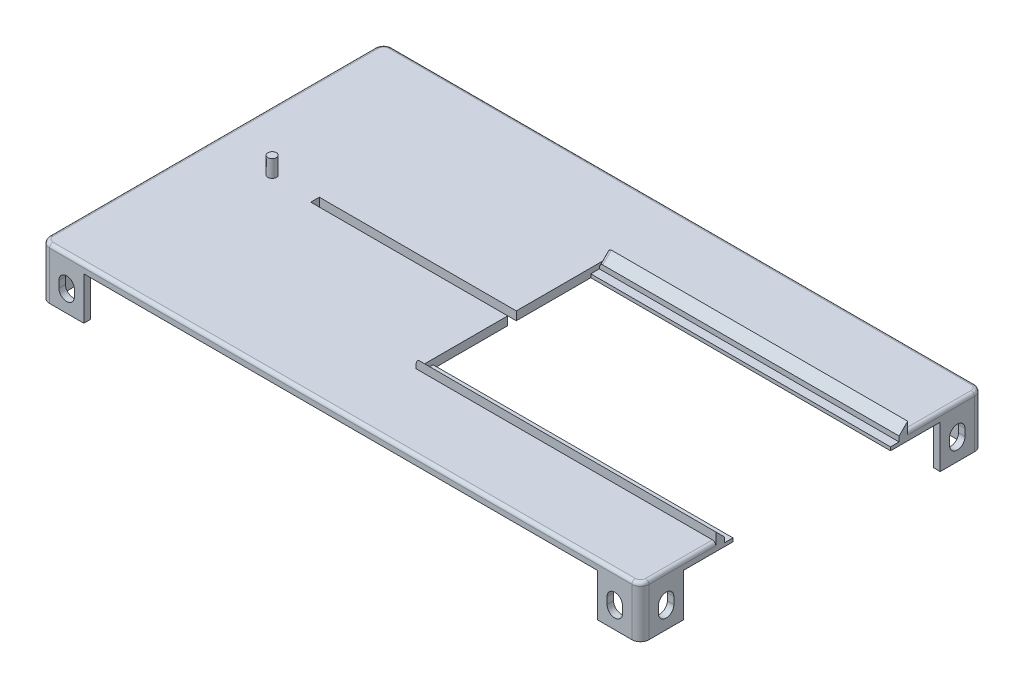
ISO-10303-21;
HEADER;
FILE_DESCRIPTION(('STEP AP214'),'2;1');
FILE_NAME('part.step','',(''),(''),'','','');
FILE_SCHEMA(('AUTOMOTIVE_DESIGN { 1 0 10303 214 1 1 1 1 }'));
ENDSEC;
DATA;
#1=APPLICATION_CONTEXT('core data for automotive mechanical design processes');
#2=APPLICATION_PROTOCOL_DEFINITION('international standard','automotive_design',2000,#1);
#3=PRODUCT_CONTEXT('',#1,'mechanical');
#4=PRODUCT('Part','Part','',(#3));
#5=PRODUCT_RELATED_PRODUCT_CATEGORY('part','',(#4));
#6=PRODUCT_DEFINITION_FORMATION('','',#4);
#7=PRODUCT_DEFINITION_CONTEXT('part definition',#1,'design');
#8=PRODUCT_DEFINITION('design','',#6,#7);
#9=PRODUCT_DEFINITION_SHAPE('','',#8);
#10=(LENGTH_UNIT() NAMED_UNIT(*) SI_UNIT(.MILLI.,.METRE.));
#11=(NAMED_UNIT(*) PLANE_ANGLE_UNIT() SI_UNIT($,.RADIAN.));
#12=(NAMED_UNIT(*) SI_UNIT($,.STERADIAN.) SOLID_ANGLE_UNIT());
#13=UNCERTAINTY_MEASURE_WITH_UNIT(LENGTH_MEASURE(1.E-05),#10,'distance_accuracy_value','');
#14=(GEOMETRIC_REPRESENTATION_CONTEXT(3) GLOBAL_UNCERTAINTY_ASSIGNED_CONTEXT((#13)) GLOBAL_UNIT_ASSIGNED_CONTEXT((#10,
#11,#12)) REPRESENTATION_CONTEXT('',''));
#15=CARTESIAN_POINT('',(0.,0.,0.));
#16=DIRECTION('',(0.,0.,1.));
#17=DIRECTION('',(1.,0.,0.));
#18=AXIS2_PLACEMENT_3D('',#15,#16,#17);
#19=CARTESIAN_POINT('',(0.,2.,0.));
#20=DIRECTION('',(-1.,0.,0.));
#21=DIRECTION('',(0.,0.,1.));
#22=AXIS2_PLACEMENT_3D('',#19,#20,#21);
#23=PLANE('',#22);
#24=DIRECTION('',(0.,0.,1.));
#25=VECTOR('',#24,1.);
#26=CARTESIAN_POINT('',(0.,5.,0.));
#27=LINE('',#26,#25);
#28=CARTESIAN_POINT('',(0.,5.,-53.8284271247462));
#29=VERTEX_POINT('',#28);
#30=CARTESIAN_POINT('',(0.,5.,-2.5));
#31=VERTEX_POINT('',#30);
#32=EDGE_CURVE('E67',#29,#31,#27,.T.);
#33=ORIENTED_EDGE('',*,*,#32,.T.);
#34=DIRECTION('',(0.,-1.,0.));
#35=VECTOR('',#34,1.);
#36=CARTESIAN_POINT('',(0.,2.,-2.5));
#37=LINE('',#36,#35);
#38=CARTESIAN_POINT('',(0.,0.,-2.5));
#39=VERTEX_POINT('',#38);
#40=EDGE_CURVE('E11',#31,#39,#37,.T.);
#41=ORIENTED_EDGE('',*,*,#40,.T.);
#42=DIRECTION('',(0.,0.,-1.));
#43=VECTOR('',#42,1.);
#44=CARTESIAN_POINT('',(0.,0.,46.));
#45=LINE('',#44,#43);
#46=CARTESIAN_POINT('',(0.,0.,-46.));
#47=VERTEX_POINT('',#46);
#48=EDGE_CURVE('E1041',#39,#47,#45,.T.);
#49=ORIENTED_EDGE('',*,*,#48,.T.);
#50=DIRECTION('',(0.,1.,0.));
#51=VECTOR('',#50,1.);
#52=CARTESIAN_POINT('',(0.,0.,-46.));
#53=LINE('',#52,#51);
#54=CARTESIAN_POINT('',(0.,2.,-46.));
#55=VERTEX_POINT('',#54);
#56=EDGE_CURVE('E1046',#47,#55,#53,.T.);
#57=ORIENTED_EDGE('',*,*,#56,.T.);
#58=DIRECTION('',(0.,0.,1.));
#59=VECTOR('',#58,1.);
#60=CARTESIAN_POINT('',(0.,2.,0.));
#61=LINE('',#60,#59);
#62=CARTESIAN_POINT('',(0.,2.,-51.));
#63=VERTEX_POINT('',#62);
#64=EDGE_CURVE('E1066',#63,#55,#61,.T.);
#65=ORIENTED_EDGE('',*,*,#64,.F.);
#66=DIRECTION('',(0.,1.,0.));
#67=VECTOR('',#66,1.);
#68=CARTESIAN_POINT('',(0.,2.,-51.));
#69=LINE('',#68,#67);
#70=CARTESIAN_POINT('',(0.,2.17157287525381,-51.));
#71=VERTEX_POINT('',#70);
#72=EDGE_CURVE('E1094',#63,#71,#69,.T.);
#73=ORIENTED_EDGE('',*,*,#72,.T.);
#74=DIRECTION('',(0.,0.707106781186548,-0.707106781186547));
#75=VECTOR('',#74,1.);
#76=CARTESIAN_POINT('',(0.,3.58578643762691,-52.4142135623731));
#77=LINE('',#76,#75);
#78=EDGE_CURVE('E1387',#71,#29,#77,.T.);
#79=ORIENTED_EDGE('',*,*,#78,.T.);
#80=EDGE_LOOP('',(#33,#41,#49,#57,#65,#73,#79));
#81=FACE_BOUND('',#80,.T.);
#82=ADVANCED_FACE('F43',(#81),#23,.F.);
#83=CARTESIAN_POINT('',(-175.,5.,100.));
#84=DIRECTION('',(1.,0.,0.));
#85=DIRECTION('',(0.,0.,-1.));
#86=AXIS2_PLACEMENT_3D('',#83,#84,#85);
#87=PLANE('',#86);
#88=DIRECTION('',(0.,-1.,0.));
#89=VECTOR('',#88,1.);
#90=CARTESIAN_POINT('',(-175.,5.,95.));
#91=LINE('',#90,#89);
#92=CARTESIAN_POINT('',(-175.,-25.,95.));
#93=VERTEX_POINT('',#92);
#94=CARTESIAN_POINT('',(-175.,3.,95.));
#95=VERTEX_POINT('',#94);
#96=EDGE_CURVE('E1125',#93,#95,#91,.F.);
#97=ORIENTED_EDGE('',*,*,#96,.T.);
#98=DIRECTION('',(0.,0.,1.));
#99=VECTOR('',#98,1.);
#100=CARTESIAN_POINT('',(-175.,3.,100.));
#101=LINE('',#100,#99);
#102=CARTESIAN_POINT('',(-175.,3.,-95.));
#103=VERTEX_POINT('',#102);
#104=EDGE_CURVE('E1199',#95,#103,#101,.F.);
#105=ORIENTED_EDGE('',*,*,#104,.T.);
#106=DIRECTION('',(0.,-1.,0.));
#107=VECTOR('',#106,1.);
#108=CARTESIAN_POINT('',(-175.,5.,-95.));
#109=LINE('',#108,#107);
#110=CARTESIAN_POINT('',(-175.,-25.,-95.));
#111=VERTEX_POINT('',#110);
#112=EDGE_CURVE('E1129',#103,#111,#109,.T.);
#113=ORIENTED_EDGE('',*,*,#112,.T.);
#114=DIRECTION('',(0.,0.,-1.));
#115=VECTOR('',#114,1.);
#116=CARTESIAN_POINT('',(-175.,-25.,-100.));
#117=LINE('',#116,#115);
#118=CARTESIAN_POINT('',(-175.,-25.,-75.));
#119=VERTEX_POINT('',#118);
#120=EDGE_CURVE('E888',#119,#111,#117,.T.);
#121=ORIENTED_EDGE('',*,*,#120,.F.);
#122=DIRECTION('',(0.,1.,0.));
#123=VECTOR('',#122,1.);
#124=CARTESIAN_POINT('',(-175.,-25.,-75.));
#125=LINE('',#124,#123);
#126=CARTESIAN_POINT('',(-175.,0.,-75.));
#127=VERTEX_POINT('',#126);
#128=EDGE_CURVE('E930',#119,#127,#125,.T.);
#129=ORIENTED_EDGE('',*,*,#128,.T.);
#130=DIRECTION('',(0.,0.,1.));
#131=VECTOR('',#130,1.);
#132=CARTESIAN_POINT('',(-175.,0.,100.));
#133=LINE('',#132,#131);
#134=CARTESIAN_POINT('',(-175.,0.,75.));
#135=VERTEX_POINT('',#134);
#136=EDGE_CURVE('E1117',#127,#135,#133,.T.);
#137=ORIENTED_EDGE('',*,*,#136,.T.);
#138=DIRECTION('',(0.,1.,0.));
#139=VECTOR('',#138,1.);
#140=CARTESIAN_POINT('',(-175.,-25.,75.));
#141=LINE('',#140,#139);
#142=CARTESIAN_POINT('',(-175.,-25.,75.));
#143=VERTEX_POINT('',#142);
#144=EDGE_CURVE('E880',#143,#135,#141,.T.);
#145=ORIENTED_EDGE('',*,*,#144,.F.);
#146=DIRECTION('',(0.,0.,-1.));
#147=VECTOR('',#146,1.);
#148=CARTESIAN_POINT('',(-175.,-25.,100.));
#149=LINE('',#148,#147);
#150=EDGE_CURVE('E834',#93,#143,#149,.T.);
#151=ORIENTED_EDGE('',*,*,#150,.F.);
#152=EDGE_LOOP('',(#97,#105,#113,#121,#129,#137,#145,#151));
#153=FACE_BOUND('',#152,.T.);
#154=CARTESIAN_POINT('',(-175.,-14.5237678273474,85.));
#155=DIRECTION('',(1.,0.,0.));
#156=DIRECTION('',(0.,0.,-1.));
#157=AXIS2_PLACEMENT_3D('',#154,#155,#156);
#158=CIRCLE('',#157,4.5);
#159=CARTESIAN_POINT('',(-175.,-14.5237678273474,89.5));
#160=VERTEX_POINT('',#159);
#161=CARTESIAN_POINT('',(-175.,-14.5237678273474,80.5));
#162=VERTEX_POINT('',#161);
#163=EDGE_CURVE('E580',#160,#162,#158,.T.);
#164=ORIENTED_EDGE('',*,*,#163,.T.);
#165=DIRECTION('',(0.,1.,0.));
#166=VECTOR('',#165,1.);
#167=CARTESIAN_POINT('',(-175.,-14.5237678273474,80.5));
#168=LINE('',#167,#166);
#169=CARTESIAN_POINT('',(-175.,-10.4762321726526,80.5));
#170=VERTEX_POINT('',#169);
#171=EDGE_CURVE('E592',#162,#170,#168,.T.);
#172=ORIENTED_EDGE('',*,*,#171,.T.);
#173=CARTESIAN_POINT('',(-175.,-10.4762321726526,85.));
#174=DIRECTION('',(1.,0.,0.));
#175=DIRECTION('',(0.,0.,-1.));
#176=AXIS2_PLACEMENT_3D('',#173,#174,#175);
#177=CIRCLE('',#176,4.5);
#178=CARTESIAN_POINT('',(-175.,-10.4762321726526,89.5));
#179=VERTEX_POINT('',#178);
#180=EDGE_CURVE('E588',#170,#179,#177,.T.);
#181=ORIENTED_EDGE('',*,*,#180,.T.);
#182=DIRECTION('',(0.,-1.,0.));
#183=VECTOR('',#182,1.);
#184=CARTESIAN_POINT('',(-175.,-14.5237678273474,89.5));
#185=LINE('',#184,#183);
#186=EDGE_CURVE('E584',#179,#160,#185,.T.);
#187=ORIENTED_EDGE('',*,*,#186,.T.);
#188=EDGE_LOOP('',(#164,#172,#181,#187));
#189=FACE_BOUND('',#188,.T.);
#190=ADVANCED_FACE('F1452',(#153,#189),#87,.F.);
#191=CARTESIAN_POINT('',(-171.2,-25.,75.));
#192=DIRECTION('',(-1.,0.,0.));
#193=DIRECTION('',(0.,0.,1.));
#194=AXIS2_PLACEMENT_3D('',#191,#192,#193);
#195=PLANE('',#194);
#196=DIRECTION('',(0.,0.,1.));
#197=VECTOR('',#196,1.);
#198=CARTESIAN_POINT('',(-171.2,0.,75.));
#199=LINE('',#198,#197);
#200=CARTESIAN_POINT('',(-171.2,0.,75.));
#201=VERTEX_POINT('',#200);
#202=CARTESIAN_POINT('',(-171.2,0.,96.2));
#203=VERTEX_POINT('',#202);
#204=EDGE_CURVE('E857',#201,#203,#199,.T.);
#205=ORIENTED_EDGE('',*,*,#204,.T.);
#206=DIRECTION('',(0.,1.,0.));
#207=VECTOR('',#206,1.);
#208=CARTESIAN_POINT('',(-171.2,-25.,96.2));
#209=LINE('',#208,#207);
#210=CARTESIAN_POINT('',(-171.2,-25.,96.2));
#211=VERTEX_POINT('',#210);
#212=EDGE_CURVE('E872',#211,#203,#209,.T.);
#213=ORIENTED_EDGE('',*,*,#212,.F.);
#214=DIRECTION('',(0.,0.,1.));
#215=VECTOR('',#214,1.);
#216=CARTESIAN_POINT('',(-171.2,-25.,75.));
#217=LINE('',#216,#215);
#218=CARTESIAN_POINT('',(-171.2,-25.,75.));
#219=VERTEX_POINT('',#218);
#220=EDGE_CURVE('E841',#219,#211,#217,.T.);
#221=ORIENTED_EDGE('',*,*,#220,.F.);
#222=DIRECTION('',(0.,1.,0.));
#223=VECTOR('',#222,1.);
#224=CARTESIAN_POINT('',(-171.2,-25.,75.));
#225=LINE('',#224,#223);
#226=EDGE_CURVE('E876',#219,#201,#225,.T.);
#227=ORIENTED_EDGE('',*,*,#226,.T.);
#228=EDGE_LOOP('',(#205,#213,#221,#227));
#229=FACE_BOUND('',#228,.T.);
#230=CARTESIAN_POINT('',(-171.2,-14.5237678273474,85.));
#231=DIRECTION('',(-1.,0.,0.));
#232=DIRECTION('',(0.,0.,1.));
#233=AXIS2_PLACEMENT_3D('',#230,#231,#232);
#234=CIRCLE('',#233,4.5);
#235=CARTESIAN_POINT('',(-171.2,-14.5237678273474,89.5));
#236=VERTEX_POINT('',#235);
#237=CARTESIAN_POINT('',(-171.2,-14.5237678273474,80.5));
#238=VERTEX_POINT('',#237);
#239=EDGE_CURVE('E1354',#236,#238,#234,.F.);
#240=ORIENTED_EDGE('',*,*,#239,.F.);
#241=DIRECTION('',(0.,-1.,0.));
#242=VECTOR('',#241,1.);
#243=CARTESIAN_POINT('',(-171.2,-25.,89.5));
#244=LINE('',#243,#242);
#245=CARTESIAN_POINT('',(-171.2,-10.4762321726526,89.5));
#246=VERTEX_POINT('',#245);
#247=EDGE_CURVE('E1344',#246,#236,#244,.T.);
#248=ORIENTED_EDGE('',*,*,#247,.F.);
#249=CARTESIAN_POINT('',(-171.2,-10.4762321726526,85.));
#250=DIRECTION('',(-1.,0.,0.));
#251=DIRECTION('',(0.,0.,1.));
#252=AXIS2_PLACEMENT_3D('',#249,#250,#251);
#253=CIRCLE('',#252,4.5);
#254=CARTESIAN_POINT('',(-171.2,-10.4762321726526,80.5));
#255=VERTEX_POINT('',#254);
#256=EDGE_CURVE('E1347',#255,#246,#253,.F.);
#257=ORIENTED_EDGE('',*,*,#256,.F.);
#258=DIRECTION('',(0.,1.,0.));
#259=VECTOR('',#258,1.);
#260=CARTESIAN_POINT('',(-171.2,-25.,80.5));
#261=LINE('',#260,#259);
#262=EDGE_CURVE('E1351',#238,#255,#261,.T.);
#263=ORIENTED_EDGE('',*,*,#262,.F.);
#264=EDGE_LOOP('',(#240,#248,#257,#263));
#265=FACE_BOUND('',#264,.T.);
#266=ADVANCED_FACE('F1459',(#229,#265),#195,.F.);
#267=CARTESIAN_POINT('',(175.,5.,100.));
#268=DIRECTION('',(-1.,0.,0.));
#269=DIRECTION('',(0.,0.,1.));
#270=AXIS2_PLACEMENT_3D('',#267,#268,#269);
#271=PLANE('',#270);
#272=DIRECTION('',(0.,-1.,0.));
#273=VECTOR('',#272,1.);
#274=CARTESIAN_POINT('',(175.,5.,-95.));
#275=LINE('',#274,#273);
#276=CARTESIAN_POINT('',(175.,-25.,-95.));
#277=VERTEX_POINT('',#276);
#278=CARTESIAN_POINT('',(175.,3.,-95.));
#279=VERTEX_POINT('',#278);
#280=EDGE_CURVE('E1145',#277,#279,#275,.F.);
#281=ORIENTED_EDGE('',*,*,#280,.T.);
#282=DIRECTION('',(0.,0.,-1.));
#283=VECTOR('',#282,1.);
#284=CARTESIAN_POINT('',(175.,3.,100.));
#285=LINE('',#284,#283);
#286=CARTESIAN_POINT('',(175.,3.,-56.));
#287=VERTEX_POINT('',#286);
#288=EDGE_CURVE('E1211',#279,#287,#285,.F.);
#289=ORIENTED_EDGE('',*,*,#288,.T.);
#290=DIRECTION('',(0.,1.,0.));
#291=VECTOR('',#290,1.);
#292=CARTESIAN_POINT('',(175.,5.,-56.));
#293=LINE('',#292,#291);
#294=CARTESIAN_POINT('',(175.,10.,-56.));
#295=VERTEX_POINT('',#294);
#296=EDGE_CURVE('E989',#287,#295,#293,.T.);
#297=ORIENTED_EDGE('',*,*,#296,.T.);
#298=DIRECTION('',(0.,-0.707106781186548,0.707106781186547));
#299=VECTOR('',#298,1.);
#300=CARTESIAN_POINT('',(175.,10.,-56.));
#301=LINE('',#300,#299);
#302=CARTESIAN_POINT('',(175.,5.,-51.));
#303=VERTEX_POINT('',#302);
#304=EDGE_CURVE('E994',#295,#303,#301,.T.);
#305=ORIENTED_EDGE('',*,*,#304,.T.);
#306=DIRECTION('',(0.,1.,0.));
#307=VECTOR('',#306,1.);
#308=CARTESIAN_POINT('',(175.,2.,-51.));
#309=LINE('',#308,#307);
#310=CARTESIAN_POINT('',(175.,2.,-51.));
#311=VERTEX_POINT('',#310);
#312=EDGE_CURVE('E1099',#311,#303,#309,.T.);
#313=ORIENTED_EDGE('',*,*,#312,.F.);
#314=DIRECTION('',(0.,0.,-1.));
#315=VECTOR('',#314,1.);
#316=CARTESIAN_POINT('',(175.,2.,-51.));
#317=LINE('',#316,#315);
#318=CARTESIAN_POINT('',(175.,2.,-46.));
#319=VERTEX_POINT('',#318);
#320=EDGE_CURVE('E1075',#319,#311,#317,.T.);
#321=ORIENTED_EDGE('',*,*,#320,.F.);
#322=DIRECTION('',(0.,1.,0.));
#323=VECTOR('',#322,1.);
#324=CARTESIAN_POINT('',(175.,0.,-46.));
#325=LINE('',#324,#323);
#326=CARTESIAN_POINT('',(175.,0.,-46.));
#327=VERTEX_POINT('',#326);
#328=EDGE_CURVE('E1062',#327,#319,#325,.T.);
#329=ORIENTED_EDGE('',*,*,#328,.F.);
#330=DIRECTION('',(0.,0.,-1.));
#331=VECTOR('',#330,1.);
#332=CARTESIAN_POINT('',(175.,0.,100.));
#333=LINE('',#332,#331);
#334=CARTESIAN_POINT('',(175.,0.,-75.));
#335=VERTEX_POINT('',#334);
#336=EDGE_CURVE('E1098',#327,#335,#333,.T.);
#337=ORIENTED_EDGE('',*,*,#336,.T.);
#338=DIRECTION('',(0.,1.,0.));
#339=VECTOR('',#338,1.);
#340=CARTESIAN_POINT('',(175.,-25.,-75.));
#341=LINE('',#340,#339);
#342=CARTESIAN_POINT('',(175.,-25.,-75.));
#343=VERTEX_POINT('',#342);
#344=EDGE_CURVE('E985',#343,#335,#341,.T.);
#345=ORIENTED_EDGE('',*,*,#344,.F.);
#346=DIRECTION('',(0.,0.,1.));
#347=VECTOR('',#346,1.);
#348=CARTESIAN_POINT('',(175.,-25.,-100.));
#349=LINE('',#348,#347);
#350=EDGE_CURVE('E935',#277,#343,#349,.T.);
#351=ORIENTED_EDGE('',*,*,#350,.F.);
#352=EDGE_LOOP('',(#281,#289,#297,#305,#313,#321,#329,#337,#345,#351));
#353=FACE_BOUND('',#352,.T.);
#354=CARTESIAN_POINT('',(175.,-14.5237678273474,-85.));
#355=DIRECTION('',(-1.,0.,0.));
#356=DIRECTION('',(0.,0.,1.));
#357=AXIS2_PLACEMENT_3D('',#354,#355,#356);
#358=CIRCLE('',#357,4.5);
#359=CARTESIAN_POINT('',(175.,-14.5237678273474,-89.5));
#360=VERTEX_POINT('',#359);
#361=CARTESIAN_POINT('',(175.,-14.5237678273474,-80.5));
#362=VERTEX_POINT('',#361);
#363=EDGE_CURVE('E600',#360,#362,#358,.T.);
#364=ORIENTED_EDGE('',*,*,#363,.T.);
#365=DIRECTION('',(0.,1.,0.));
#366=VECTOR('',#365,1.);
#367=CARTESIAN_POINT('',(175.,-14.5237678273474,-80.5));
#368=LINE('',#367,#366);
#369=CARTESIAN_POINT('',(175.,-10.4762321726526,-80.5));
#370=VERTEX_POINT('',#369);
#371=EDGE_CURVE('E621',#362,#370,#368,.T.);
#372=ORIENTED_EDGE('',*,*,#371,.T.);
#373=CARTESIAN_POINT('',(175.,-10.4762321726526,-85.));
#374=DIRECTION('',(-1.,0.,0.));
#375=DIRECTION('',(0.,0.,1.));
#376=AXIS2_PLACEMENT_3D('',#373,#374,#375);
#377=CIRCLE('',#376,4.5);
#378=CARTESIAN_POINT('',(175.,-10.4762321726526,-89.5));
#379=VERTEX_POINT('',#378);
#380=EDGE_CURVE('E617',#370,#379,#377,.T.);
#381=ORIENTED_EDGE('',*,*,#380,.T.);
#382=DIRECTION('',(0.,-1.,0.));
#383=VECTOR('',#382,1.);
#384=CARTESIAN_POINT('',(175.,-14.5237678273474,-89.5));
#385=LINE('',#384,#383);
#386=EDGE_CURVE('E613',#379,#360,#385,.T.);
#387=ORIENTED_EDGE('',*,*,#386,.T.);
#388=EDGE_LOOP('',(#364,#372,#381,#387));
#389=FACE_BOUND('',#388,.T.);
#390=ADVANCED_FACE('F1517',(#353,#389),#271,.F.);
#391=CARTESIAN_POINT('',(171.2,-25.,-75.));
#392=DIRECTION('',(1.,0.,0.));
#393=DIRECTION('',(0.,0.,-1.));
#394=AXIS2_PLACEMENT_3D('',#391,#392,#393);
#395=PLANE('',#394);
#396=DIRECTION('',(0.,0.,-1.));
#397=VECTOR('',#396,1.);
#398=CARTESIAN_POINT('',(171.2,0.,-75.));
#399=LINE('',#398,#397);
#400=CARTESIAN_POINT('',(171.2,0.,-75.));
#401=VERTEX_POINT('',#400);
#402=CARTESIAN_POINT('',(171.2,0.,-96.2));
#403=VERTEX_POINT('',#402);
#404=EDGE_CURVE('E959',#401,#403,#399,.T.);
#405=ORIENTED_EDGE('',*,*,#404,.T.);
#406=DIRECTION('',(0.,1.,0.));
#407=VECTOR('',#406,1.);
#408=CARTESIAN_POINT('',(171.2,-25.,-96.2));
#409=LINE('',#408,#407);
#410=CARTESIAN_POINT('',(171.2,-25.,-96.2));
#411=VERTEX_POINT('',#410);
#412=EDGE_CURVE('E977',#411,#403,#409,.T.);
#413=ORIENTED_EDGE('',*,*,#412,.F.);
#414=DIRECTION('',(0.,0.,-1.));
#415=VECTOR('',#414,1.);
#416=CARTESIAN_POINT('',(171.2,-25.,-75.));
#417=LINE('',#416,#415);
#418=CARTESIAN_POINT('',(171.2,-25.,-75.));
#419=VERTEX_POINT('',#418);
#420=EDGE_CURVE('E942',#419,#411,#417,.T.);
#421=ORIENTED_EDGE('',*,*,#420,.F.);
#422=DIRECTION('',(0.,1.,0.));
#423=VECTOR('',#422,1.);
#424=CARTESIAN_POINT('',(171.2,-25.,-75.));
#425=LINE('',#424,#423);
#426=EDGE_CURVE('E981',#419,#401,#425,.T.);
#427=ORIENTED_EDGE('',*,*,#426,.T.);
#428=EDGE_LOOP('',(#405,#413,#421,#427));
#429=FACE_BOUND('',#428,.T.);
#430=CARTESIAN_POINT('',(171.2,-14.5237678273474,-85.));
#431=DIRECTION('',(1.,0.,0.));
#432=DIRECTION('',(0.,0.,-1.));
#433=AXIS2_PLACEMENT_3D('',#430,#431,#432);
#434=CIRCLE('',#433,4.5);
#435=CARTESIAN_POINT('',(171.2,-14.5237678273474,-89.5));
#436=VERTEX_POINT('',#435);
#437=CARTESIAN_POINT('',(171.2,-14.5237678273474,-80.5));
#438=VERTEX_POINT('',#437);
#439=EDGE_CURVE('E1341',#436,#438,#434,.F.);
#440=ORIENTED_EDGE('',*,*,#439,.F.);
#441=DIRECTION('',(0.,-1.,0.));
#442=VECTOR('',#441,1.);
#443=CARTESIAN_POINT('',(171.2,-25.,-89.5));
#444=LINE('',#443,#442);
#445=CARTESIAN_POINT('',(171.2,-10.4762321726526,-89.5));
#446=VERTEX_POINT('',#445);
#447=EDGE_CURVE('E1331',#446,#436,#444,.T.);
#448=ORIENTED_EDGE('',*,*,#447,.F.);
#449=CARTESIAN_POINT('',(171.2,-10.4762321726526,-85.));
#450=DIRECTION('',(1.,0.,0.));
#451=DIRECTION('',(0.,0.,-1.));
#452=AXIS2_PLACEMENT_3D('',#449,#450,#451);
#453=CIRCLE('',#452,4.5);
#454=CARTESIAN_POINT('',(171.2,-10.4762321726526,-80.5));
#455=VERTEX_POINT('',#454);
#456=EDGE_CURVE('E1334',#455,#446,#453,.F.);
#457=ORIENTED_EDGE('',*,*,#456,.F.);
#458=DIRECTION('',(0.,1.,0.));
#459=VECTOR('',#458,1.);
#460=CARTESIAN_POINT('',(171.2,-25.,-80.5));
#461=LINE('',#460,#459);
#462=EDGE_CURVE('E1338',#438,#455,#461,.T.);
#463=ORIENTED_EDGE('',*,*,#462,.F.);
#464=EDGE_LOOP('',(#440,#448,#457,#463));
#465=FACE_BOUND('',#464,.T.);
#466=ADVANCED_FACE('F1513',(#429,#465),#395,.F.);
#467=CARTESIAN_POINT('',(-175.,5.,-100.));
#468=DIRECTION('',(0.,0.,1.));
#469=DIRECTION('',(1.,0.,0.));
#470=AXIS2_PLACEMENT_3D('',#467,#468,#469);
#471=PLANE('',#470);
#472=DIRECTION('',(0.,-1.,0.));
#473=VECTOR('',#472,1.);
#474=CARTESIAN_POINT('',(-170.,5.,-100.));
#475=LINE('',#474,#473);
#476=CARTESIAN_POINT('',(-170.,-25.,-100.));
#477=VERTEX_POINT('',#476);
#478=CARTESIAN_POINT('',(-170.,3.,-100.));
#479=VERTEX_POINT('',#478);
#480=EDGE_CURVE('E1138',#477,#479,#475,.F.);
#481=ORIENTED_EDGE('',*,*,#480,.T.);
#482=DIRECTION('',(-1.,0.,0.));
#483=VECTOR('',#482,1.);
#484=CARTESIAN_POINT('',(-175.,3.,-100.));
#485=LINE('',#484,#483);
#486=CARTESIAN_POINT('',(170.,3.,-100.));
#487=VERTEX_POINT('',#486);
#488=EDGE_CURVE('E1205',#479,#487,#485,.F.);
#489=ORIENTED_EDGE('',*,*,#488,.T.);
#490=DIRECTION('',(0.,-1.,0.));
#491=VECTOR('',#490,1.);
#492=CARTESIAN_POINT('',(170.,5.,-100.));
#493=LINE('',#492,#491);
#494=CARTESIAN_POINT('',(170.,-25.,-100.));
#495=VERTEX_POINT('',#494);
#496=EDGE_CURVE('E1135',#487,#495,#493,.T.);
#497=ORIENTED_EDGE('',*,*,#496,.T.);
#498=DIRECTION('',(1.,0.,0.));
#499=VECTOR('',#498,1.);
#500=CARTESIAN_POINT('',(175.,-25.,-100.));
#501=LINE('',#500,#499);
#502=CARTESIAN_POINT('',(150.,-25.,-100.));
#503=VERTEX_POINT('',#502);
#504=EDGE_CURVE('E951',#503,#495,#501,.T.);
#505=ORIENTED_EDGE('',*,*,#504,.F.);
#506=DIRECTION('',(0.,1.,0.));
#507=VECTOR('',#506,1.);
#508=CARTESIAN_POINT('',(150.,-25.,-100.));
#509=LINE('',#508,#507);
#510=CARTESIAN_POINT('',(150.,0.,-100.));
#511=VERTEX_POINT('',#510);
#512=EDGE_CURVE('E955',#503,#511,#509,.T.);
#513=ORIENTED_EDGE('',*,*,#512,.T.);
#514=DIRECTION('',(-1.,0.,0.));
#515=VECTOR('',#514,1.);
#516=CARTESIAN_POINT('',(-175.,0.,-100.));
#517=LINE('',#516,#515);
#518=CARTESIAN_POINT('',(-150.,0.,-100.));
#519=VERTEX_POINT('',#518);
#520=EDGE_CURVE('E1113',#511,#519,#517,.T.);
#521=ORIENTED_EDGE('',*,*,#520,.T.);
#522=DIRECTION('',(0.,1.,0.));
#523=VECTOR('',#522,1.);
#524=CARTESIAN_POINT('',(-150.,-25.,-100.));
#525=LINE('',#524,#523);
#526=CARTESIAN_POINT('',(-150.,-25.,-100.));
#527=VERTEX_POINT('',#526);
#528=EDGE_CURVE('E927',#527,#519,#525,.T.);
#529=ORIENTED_EDGE('',*,*,#528,.F.);
#530=DIRECTION('',(1.,0.,0.));
#531=VECTOR('',#530,1.);
#532=CARTESIAN_POINT('',(-175.,-25.,-100.));
#533=LINE('',#532,#531);
#534=EDGE_CURVE('E893',#477,#527,#533,.T.);
#535=ORIENTED_EDGE('',*,*,#534,.F.);
#536=EDGE_LOOP('',(#481,#489,#497,#505,#513,#521,#529,#535));
#537=FACE_BOUND('',#536,.T.);
#538=DIRECTION('',(0.,1.,0.));
#539=VECTOR('',#538,1.);
#540=CARTESIAN_POINT('',(-164.5,-14.5,-100.));
#541=LINE('',#540,#539);
#542=CARTESIAN_POINT('',(-164.5,-14.5,-100.));
#543=VERTEX_POINT('',#542);
#544=CARTESIAN_POINT('',(-164.5,-10.5,-100.));
#545=VERTEX_POINT('',#544);
#546=EDGE_CURVE('E698',#543,#545,#541,.T.);
#547=ORIENTED_EDGE('',*,*,#546,.F.);
#548=CARTESIAN_POINT('',(-160.,-14.5,-100.));
#549=DIRECTION('',(0.,0.,-1.));
#550=DIRECTION('',(-1.,0.,0.));
#551=AXIS2_PLACEMENT_3D('',#548,#549,#550);
#552=CIRCLE('',#551,4.50000000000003);
#553=CARTESIAN_POINT('',(-155.5,-14.5,-100.));
#554=VERTEX_POINT('',#553);
#555=EDGE_CURVE('E686',#554,#543,#552,.T.);
#556=ORIENTED_EDGE('',*,*,#555,.F.);
#557=DIRECTION('',(0.,-1.,0.));
#558=VECTOR('',#557,1.);
#559=CARTESIAN_POINT('',(-155.5,-14.5,-100.));
#560=LINE('',#559,#558);
#561=CARTESIAN_POINT('',(-155.5,-10.5,-100.));
#562=VERTEX_POINT('',#561);
#563=EDGE_CURVE('E706',#562,#554,#560,.T.);
#564=ORIENTED_EDGE('',*,*,#563,.F.);
#565=CARTESIAN_POINT('',(-160.,-10.5,-100.));
#566=DIRECTION('',(0.,0.,-1.));
#567=DIRECTION('',(-1.,0.,0.));
#568=AXIS2_PLACEMENT_3D('',#565,#566,#567);
#569=CIRCLE('',#568,4.50000000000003);
#570=EDGE_CURVE('E702',#545,#562,#569,.T.);
#571=ORIENTED_EDGE('',*,*,#570,.F.);
#572=EDGE_LOOP('',(#547,#556,#564,#571));
#573=FACE_BOUND('',#572,.T.);
#574=CARTESIAN_POINT('',(160.,-14.5,-100.));
#575=DIRECTION('',(0.,0.,1.));
#576=DIRECTION('',(1.,0.,0.));
#577=AXIS2_PLACEMENT_3D('',#574,#575,#576);
#578=CIRCLE('',#577,4.50000000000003);
#579=CARTESIAN_POINT('',(155.5,-14.5,-100.));
#580=VERTEX_POINT('',#579);
#581=CARTESIAN_POINT('',(164.5,-14.5,-100.));
#582=VERTEX_POINT('',#581);
#583=EDGE_CURVE('E657',#580,#582,#578,.T.);
#584=ORIENTED_EDGE('',*,*,#583,.T.);
#585=DIRECTION('',(0.,1.,0.));
#586=VECTOR('',#585,1.);
#587=CARTESIAN_POINT('',(164.5,-14.5,-100.));
#588=LINE('',#587,#586);
#589=CARTESIAN_POINT('',(164.5,-10.5,-100.));
#590=VERTEX_POINT('',#589);
#591=EDGE_CURVE('E678',#582,#590,#588,.T.);
#592=ORIENTED_EDGE('',*,*,#591,.T.);
#593=CARTESIAN_POINT('',(160.,-10.5,-100.));
#594=DIRECTION('',(0.,0.,1.));
#595=DIRECTION('',(1.,0.,0.));
#596=AXIS2_PLACEMENT_3D('',#593,#594,#595);
#597=CIRCLE('',#596,4.50000000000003);
#598=CARTESIAN_POINT('',(155.5,-10.5,-100.));
#599=VERTEX_POINT('',#598);
#600=EDGE_CURVE('E674',#590,#599,#597,.T.);
#601=ORIENTED_EDGE('',*,*,#600,.T.);
#602=DIRECTION('',(0.,-1.,0.));
#603=VECTOR('',#602,1.);
#604=CARTESIAN_POINT('',(155.5,-14.5,-100.));
#605=LINE('',#604,#603);
#606=EDGE_CURVE('E670',#599,#580,#605,.T.);
#607=ORIENTED_EDGE('',*,*,#606,.T.);
#608=EDGE_LOOP('',(#584,#592,#601,#607));
#609=FACE_BOUND('',#608,.T.);
#610=ADVANCED_FACE('F1516',(#537,#573,#609),#471,.F.);
#611=CARTESIAN_POINT('',(171.2,-25.,-96.2));
#612=DIRECTION('',(0.,0.,-1.));
#613=DIRECTION('',(-1.,0.,0.));
#614=AXIS2_PLACEMENT_3D('',#611,#612,#613);
#615=PLANE('',#614);
#616=DIRECTION('',(-1.,0.,0.));
#617=VECTOR('',#616,1.);
#618=CARTESIAN_POINT('',(171.2,0.,-96.2));
#619=LINE('',#618,#617);
#620=CARTESIAN_POINT('',(150.,0.,-96.2));
#621=VERTEX_POINT('',#620);
#622=EDGE_CURVE('E963',#403,#621,#619,.T.);
#623=ORIENTED_EDGE('',*,*,#622,.T.);
#624=DIRECTION('',(0.,1.,0.));
#625=VECTOR('',#624,1.);
#626=CARTESIAN_POINT('',(150.,-25.,-96.2));
#627=LINE('',#626,#625);
#628=CARTESIAN_POINT('',(150.,-25.,-96.2));
#629=VERTEX_POINT('',#628);
#630=EDGE_CURVE('E973',#629,#621,#627,.T.);
#631=ORIENTED_EDGE('',*,*,#630,.F.);
#632=DIRECTION('',(-1.,0.,0.));
#633=VECTOR('',#632,1.);
#634=CARTESIAN_POINT('',(171.2,-25.,-96.2));
#635=LINE('',#634,#633);
#636=EDGE_CURVE('E945',#411,#629,#635,.T.);
#637=ORIENTED_EDGE('',*,*,#636,.F.);
#638=ORIENTED_EDGE('',*,*,#412,.T.);
#639=EDGE_LOOP('',(#623,#631,#637,#638));
#640=FACE_BOUND('',#639,.T.);
#641=CARTESIAN_POINT('',(160.,-14.5,-96.2));
#642=DIRECTION('',(0.,0.,-1.));
#643=DIRECTION('',(-1.,0.,0.));
#644=AXIS2_PLACEMENT_3D('',#641,#642,#643);
#645=CIRCLE('',#644,4.50000000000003);
#646=CARTESIAN_POINT('',(155.5,-14.5,-96.2));
#647=VERTEX_POINT('',#646);
#648=CARTESIAN_POINT('',(164.5,-14.5,-96.2));
#649=VERTEX_POINT('',#648);
#650=EDGE_CURVE('E1312',#647,#649,#645,.F.);
#651=ORIENTED_EDGE('',*,*,#650,.F.);
#652=DIRECTION('',(0.,-1.,0.));
#653=VECTOR('',#652,1.);
#654=CARTESIAN_POINT('',(155.5,-25.,-96.2));
#655=LINE('',#654,#653);
#656=CARTESIAN_POINT('',(155.5,-10.5,-96.2));
#657=VERTEX_POINT('',#656);
#658=EDGE_CURVE('E1302',#657,#647,#655,.T.);
#659=ORIENTED_EDGE('',*,*,#658,.F.);
#660=CARTESIAN_POINT('',(160.,-10.5,-96.2));
#661=DIRECTION('',(0.,0.,-1.));
#662=DIRECTION('',(-1.,0.,0.));
#663=AXIS2_PLACEMENT_3D('',#660,#661,#662);
#664=CIRCLE('',#663,4.50000000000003);
#665=CARTESIAN_POINT('',(164.5,-10.5,-96.2));
#666=VERTEX_POINT('',#665);
#667=EDGE_CURVE('E1305',#666,#657,#664,.F.);
#668=ORIENTED_EDGE('',*,*,#667,.F.);
#669=DIRECTION('',(0.,1.,0.));
#670=VECTOR('',#669,1.);
#671=CARTESIAN_POINT('',(164.5,-25.,-96.2));
#672=LINE('',#671,#670);
#673=EDGE_CURVE('E1309',#649,#666,#672,.T.);
#674=ORIENTED_EDGE('',*,*,#673,.F.);
#675=EDGE_LOOP('',(#651,#659,#668,#674));
#676=FACE_BOUND('',#675,.T.);
#677=ADVANCED_FACE('F1519',(#640,#676),#615,.F.);
#678=CARTESIAN_POINT('',(-175.,5.,100.));
#679=DIRECTION('',(0.,0.,-1.));
#680=DIRECTION('',(-1.,0.,0.));
#681=AXIS2_PLACEMENT_3D('',#678,#679,#680);
#682=PLANE('',#681);
#683=DIRECTION('',(0.,-1.,0.));
#684=VECTOR('',#683,1.);
#685=CARTESIAN_POINT('',(170.,5.,100.));
#686=LINE('',#685,#684);
#687=CARTESIAN_POINT('',(170.,-25.,100.));
#688=VERTEX_POINT('',#687);
#689=CARTESIAN_POINT('',(170.,3.,100.));
#690=VERTEX_POINT('',#689);
#691=EDGE_CURVE('E1158',#688,#690,#686,.F.);
#692=ORIENTED_EDGE('',*,*,#691,.T.);
#693=DIRECTION('',(1.,0.,0.));
#694=VECTOR('',#693,1.);
#695=CARTESIAN_POINT('',(-175.,3.,100.));
#696=LINE('',#695,#694);
#697=CARTESIAN_POINT('',(-170.,3.,100.));
#698=VERTEX_POINT('',#697);
#699=EDGE_CURVE('E1193',#690,#698,#696,.F.);
#700=ORIENTED_EDGE('',*,*,#699,.T.);
#701=DIRECTION('',(0.,-1.,0.));
#702=VECTOR('',#701,1.);
#703=CARTESIAN_POINT('',(-170.,5.,100.));
#704=LINE('',#703,#702);
#705=CARTESIAN_POINT('',(-170.,-25.,100.));
#706=VERTEX_POINT('',#705);
#707=EDGE_CURVE('E1155',#698,#706,#704,.T.);
#708=ORIENTED_EDGE('',*,*,#707,.T.);
#709=DIRECTION('',(-1.,0.,0.));
#710=VECTOR('',#709,1.);
#711=CARTESIAN_POINT('',(-175.,-25.,100.));
#712=LINE('',#711,#710);
#713=CARTESIAN_POINT('',(-150.,-25.,100.));
#714=VERTEX_POINT('',#713);
#715=EDGE_CURVE('E850',#714,#706,#712,.T.);
#716=ORIENTED_EDGE('',*,*,#715,.F.);
#717=DIRECTION('',(0.,1.,0.));
#718=VECTOR('',#717,1.);
#719=CARTESIAN_POINT('',(-150.,-25.,100.));
#720=LINE('',#719,#718);
#721=CARTESIAN_POINT('',(-150.,0.,100.));
#722=VERTEX_POINT('',#721);
#723=EDGE_CURVE('E854',#714,#722,#720,.T.);
#724=ORIENTED_EDGE('',*,*,#723,.T.);
#725=DIRECTION('',(1.,0.,0.));
#726=VECTOR('',#725,1.);
#727=CARTESIAN_POINT('',(-175.,0.,100.));
#728=LINE('',#727,#726);
#729=CARTESIAN_POINT('',(150.,0.,100.));
#730=VERTEX_POINT('',#729);
#731=EDGE_CURVE('E1121',#722,#730,#728,.T.);
#732=ORIENTED_EDGE('',*,*,#731,.T.);
#733=DIRECTION('',(0.,1.,0.));
#734=VECTOR('',#733,1.);
#735=CARTESIAN_POINT('',(150.,-25.,100.));
#736=LINE('',#735,#734);
#737=CARTESIAN_POINT('',(150.,-25.,100.));
#738=VERTEX_POINT('',#737);
#739=EDGE_CURVE('E827',#738,#730,#736,.T.);
#740=ORIENTED_EDGE('',*,*,#739,.F.);
#741=DIRECTION('',(-1.,0.,0.));
#742=VECTOR('',#741,1.);
#743=CARTESIAN_POINT('',(175.,-25.,100.));
#744=LINE('',#743,#742);
#745=EDGE_CURVE('E790',#688,#738,#744,.T.);
#746=ORIENTED_EDGE('',*,*,#745,.F.);
#747=EDGE_LOOP('',(#692,#700,#708,#716,#724,#732,#740,#746));
#748=FACE_BOUND('',#747,.T.);
#749=DIRECTION('',(0.,1.,0.));
#750=VECTOR('',#749,1.);
#751=CARTESIAN_POINT('',(164.5,-14.5,100.));
#752=LINE('',#751,#750);
#753=CARTESIAN_POINT('',(164.5,-14.5,100.));
#754=VERTEX_POINT('',#753);
#755=CARTESIAN_POINT('',(164.5,-10.5,100.));
#756=VERTEX_POINT('',#755);
#757=EDGE_CURVE('E755',#754,#756,#752,.T.);
#758=ORIENTED_EDGE('',*,*,#757,.F.);
#759=CARTESIAN_POINT('',(160.,-14.5,100.));
#760=DIRECTION('',(0.,0.,1.));
#761=DIRECTION('',(1.,0.,0.));
#762=AXIS2_PLACEMENT_3D('',#759,#760,#761);
#763=CIRCLE('',#762,4.50000000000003);
#764=CARTESIAN_POINT('',(155.5,-14.5,100.));
#765=VERTEX_POINT('',#764);
#766=EDGE_CURVE('E743',#765,#754,#763,.T.);
#767=ORIENTED_EDGE('',*,*,#766,.F.);
#768=DIRECTION('',(0.,-1.,0.));
#769=VECTOR('',#768,1.);
#770=CARTESIAN_POINT('',(155.5,-14.5,100.));
#771=LINE('',#770,#769);
#772=CARTESIAN_POINT('',(155.5,-10.5,100.));
#773=VERTEX_POINT('',#772);
#774=EDGE_CURVE('E763',#773,#765,#771,.T.);
#775=ORIENTED_EDGE('',*,*,#774,.F.);
#776=CARTESIAN_POINT('',(160.,-10.5,100.));
#777=DIRECTION('',(0.,0.,1.));
#778=DIRECTION('',(1.,0.,0.));
#779=AXIS2_PLACEMENT_3D('',#776,#777,#778);
#780=CIRCLE('',#779,4.50000000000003);
#781=EDGE_CURVE('E759',#756,#773,#780,.T.);
#782=ORIENTED_EDGE('',*,*,#781,.F.);
#783=EDGE_LOOP('',(#758,#767,#775,#782));
#784=FACE_BOUND('',#783,.T.);
#785=CARTESIAN_POINT('',(-160.,-14.5,100.));
#786=DIRECTION('',(0.,0.,-1.));
#787=DIRECTION('',(-1.,0.,0.));
#788=AXIS2_PLACEMENT_3D('',#785,#786,#787);
#789=CIRCLE('',#788,4.50000000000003);
#790=CARTESIAN_POINT('',(-155.5,-14.5,100.));
#791=VERTEX_POINT('',#790);
#792=CARTESIAN_POINT('',(-164.5,-14.5,100.));
#793=VERTEX_POINT('',#792);
#794=EDGE_CURVE('E714',#791,#793,#789,.T.);
#795=ORIENTED_EDGE('',*,*,#794,.T.);
#796=DIRECTION('',(0.,1.,0.));
#797=VECTOR('',#796,1.);
#798=CARTESIAN_POINT('',(-164.5,-14.5,100.));
#799=LINE('',#798,#797);
#800=CARTESIAN_POINT('',(-164.5,-10.5,100.));
#801=VERTEX_POINT('',#800);
#802=EDGE_CURVE('E735',#793,#801,#799,.T.);
#803=ORIENTED_EDGE('',*,*,#802,.T.);
#804=CARTESIAN_POINT('',(-160.,-10.5,100.));
#805=DIRECTION('',(0.,0.,-1.));
#806=DIRECTION('',(-1.,0.,0.));
#807=AXIS2_PLACEMENT_3D('',#804,#805,#806);
#808=CIRCLE('',#807,4.50000000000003);
#809=CARTESIAN_POINT('',(-155.5,-10.5,100.));
#810=VERTEX_POINT('',#809);
#811=EDGE_CURVE('E731',#801,#810,#808,.T.);
#812=ORIENTED_EDGE('',*,*,#811,.T.);
#813=DIRECTION('',(0.,-1.,0.));
#814=VECTOR('',#813,1.);
#815=CARTESIAN_POINT('',(-155.5,-14.5,100.));
#816=LINE('',#815,#814);
#817=EDGE_CURVE('E727',#810,#791,#816,.T.);
#818=ORIENTED_EDGE('',*,*,#817,.T.);
#819=EDGE_LOOP('',(#795,#803,#812,#818));
#820=FACE_BOUND('',#819,.T.);
#821=ADVANCED_FACE('F1522',(#748,#784,#820),#682,.F.);
#822=CARTESIAN_POINT('',(-171.2,-25.,96.2));
#823=DIRECTION('',(0.,0.,1.));
#824=DIRECTION('',(1.,0.,0.));
#825=AXIS2_PLACEMENT_3D('',#822,#823,#824);
#826=PLANE('',#825);
#827=DIRECTION('',(1.,0.,0.));
#828=VECTOR('',#827,1.);
#829=CARTESIAN_POINT('',(-171.2,0.,96.2));
#830=LINE('',#829,#828);
#831=CARTESIAN_POINT('',(-150.,0.,96.2));
#832=VERTEX_POINT('',#831);
#833=EDGE_CURVE('E860',#203,#832,#830,.T.);
#834=ORIENTED_EDGE('',*,*,#833,.T.);
#835=DIRECTION('',(0.,1.,0.));
#836=VECTOR('',#835,1.);
#837=CARTESIAN_POINT('',(-150.,-25.,96.2));
#838=LINE('',#837,#836);
#839=CARTESIAN_POINT('',(-150.,-25.,96.2));
#840=VERTEX_POINT('',#839);
#841=EDGE_CURVE('E868',#840,#832,#838,.T.);
#842=ORIENTED_EDGE('',*,*,#841,.F.);
#843=DIRECTION('',(1.,0.,0.));
#844=VECTOR('',#843,1.);
#845=CARTESIAN_POINT('',(-171.2,-25.,96.2));
#846=LINE('',#845,#844);
#847=EDGE_CURVE('E844',#211,#840,#846,.T.);
#848=ORIENTED_EDGE('',*,*,#847,.F.);
#849=ORIENTED_EDGE('',*,*,#212,.T.);
#850=EDGE_LOOP('',(#834,#842,#848,#849));
#851=FACE_BOUND('',#850,.T.);
#852=CARTESIAN_POINT('',(-160.,-14.5,96.2));
#853=DIRECTION('',(0.,0.,1.));
#854=DIRECTION('',(1.,0.,0.));
#855=AXIS2_PLACEMENT_3D('',#852,#853,#854);
#856=CIRCLE('',#855,4.50000000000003);
#857=CARTESIAN_POINT('',(-155.5,-14.5,96.2));
#858=VERTEX_POINT('',#857);
#859=CARTESIAN_POINT('',(-164.5,-14.5,96.2));
#860=VERTEX_POINT('',#859);
#861=EDGE_CURVE('E1283',#858,#860,#856,.F.);
#862=ORIENTED_EDGE('',*,*,#861,.F.);
#863=DIRECTION('',(0.,-1.,0.));
#864=VECTOR('',#863,1.);
#865=CARTESIAN_POINT('',(-155.5,-25.,96.2));
#866=LINE('',#865,#864);
#867=CARTESIAN_POINT('',(-155.5,-10.5,96.2));
#868=VERTEX_POINT('',#867);
#869=EDGE_CURVE('E1273',#868,#858,#866,.T.);
#870=ORIENTED_EDGE('',*,*,#869,.F.);
#871=CARTESIAN_POINT('',(-160.,-10.5,96.2));
#872=DIRECTION('',(0.,0.,1.));
#873=DIRECTION('',(1.,0.,0.));
#874=AXIS2_PLACEMENT_3D('',#871,#872,#873);
#875=CIRCLE('',#874,4.50000000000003);
#876=CARTESIAN_POINT('',(-164.5,-10.5,96.2));
#877=VERTEX_POINT('',#876);
#878=EDGE_CURVE('E1276',#877,#868,#875,.F.);
#879=ORIENTED_EDGE('',*,*,#878,.F.);
#880=DIRECTION('',(0.,1.,0.));
#881=VECTOR('',#880,1.);
#882=CARTESIAN_POINT('',(-164.5,-25.,96.2));
#883=LINE('',#882,#881);
#884=EDGE_CURVE('E1280',#860,#877,#883,.T.);
#885=ORIENTED_EDGE('',*,*,#884,.F.);
#886=EDGE_LOOP('',(#862,#870,#879,#885));
#887=FACE_BOUND('',#886,.T.);
#888=ADVANCED_FACE('F1559',(#851,#887),#826,.F.);
#889=CARTESIAN_POINT('',(0.,0.,0.));
#890=DIRECTION('',(0.,-1.,0.));
#891=DIRECTION('',(0.,0.,-1.));
#892=AXIS2_PLACEMENT_3D('',#889,#890,#891);
#893=PLANE('',#892);
#894=DIRECTION('',(1.,0.,0.));
#895=VECTOR('',#894,1.);
#896=CARTESIAN_POINT('',(0.,0.,-2.5));
#897=LINE('',#896,#895);
#898=CARTESIAN_POINT('',(-115.,0.,-2.49999999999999));
#899=VERTEX_POINT('',#898);
#900=EDGE_CURVE('E571',#899,#39,#897,.T.);
#901=ORIENTED_EDGE('',*,*,#900,.F.);
#902=DIRECTION('',(0.,0.,-1.));
#903=VECTOR('',#902,1.);
#904=CARTESIAN_POINT('',(-115.,0.,0.));
#905=LINE('',#904,#903);
#906=CARTESIAN_POINT('',(-115.,0.,2.5));
#907=VERTEX_POINT('',#906);
#908=EDGE_CURVE('E549',#907,#899,#905,.T.);
#909=ORIENTED_EDGE('',*,*,#908,.F.);
#910=DIRECTION('',(-1.,0.,0.));
#911=VECTOR('',#910,1.);
#912=CARTESIAN_POINT('',(0.,0.,2.5));
#913=LINE('',#912,#911);
#914=CARTESIAN_POINT('',(0.,0.,2.5));
#915=VERTEX_POINT('',#914);
#916=EDGE_CURVE('E567',#915,#907,#913,.T.);
#917=ORIENTED_EDGE('',*,*,#916,.F.);
#918=CARTESIAN_POINT('',(0.,0.,46.));
#919=VERTEX_POINT('',#918);
#920=EDGE_CURVE('E1042',#919,#915,#45,.T.);
#921=ORIENTED_EDGE('',*,*,#920,.F.);
#922=DIRECTION('',(1.,0.,0.));
#923=VECTOR('',#922,1.);
#924=CARTESIAN_POINT('',(0.,0.,46.));
#925=LINE('',#924,#923);
#926=CARTESIAN_POINT('',(175.,0.,46.));
#927=VERTEX_POINT('',#926);
#928=EDGE_CURVE('E1036',#919,#927,#925,.T.);
#929=ORIENTED_EDGE('',*,*,#928,.T.);
#930=CARTESIAN_POINT('',(175.,0.,75.));
#931=VERTEX_POINT('',#930);
#932=EDGE_CURVE('E1110',#931,#927,#333,.T.);
#933=ORIENTED_EDGE('',*,*,#932,.F.);
#934=DIRECTION('',(1.,0.,0.));
#935=VECTOR('',#934,1.);
#936=CARTESIAN_POINT('',(175.,0.,75.));
#937=LINE('',#936,#935);
#938=CARTESIAN_POINT('',(171.2,0.,75.));
#939=VERTEX_POINT('',#938);
#940=EDGE_CURVE('E803',#939,#931,#937,.T.);
#941=ORIENTED_EDGE('',*,*,#940,.F.);
#942=DIRECTION('',(0.,0.,-1.));
#943=VECTOR('',#942,1.);
#944=CARTESIAN_POINT('',(171.2,0.,75.));
#945=LINE('',#944,#943);
#946=CARTESIAN_POINT('',(171.2,0.,96.2));
#947=VERTEX_POINT('',#946);
#948=EDGE_CURVE('E786',#947,#939,#945,.T.);
#949=ORIENTED_EDGE('',*,*,#948,.F.);
#950=DIRECTION('',(1.,0.,0.));
#951=VECTOR('',#950,1.);
#952=CARTESIAN_POINT('',(171.2,0.,96.2));
#953=LINE('',#952,#951);
#954=CARTESIAN_POINT('',(150.,0.,96.2));
#955=VERTEX_POINT('',#954);
#956=EDGE_CURVE('E811',#955,#947,#953,.T.);
#957=ORIENTED_EDGE('',*,*,#956,.F.);
#958=DIRECTION('',(0.,0.,-1.));
#959=VECTOR('',#958,1.);
#960=CARTESIAN_POINT('',(150.,0.,100.));
#961=LINE('',#960,#959);
#962=EDGE_CURVE('E807',#730,#955,#961,.T.);
#963=ORIENTED_EDGE('',*,*,#962,.F.);
#964=ORIENTED_EDGE('',*,*,#731,.F.);
#965=DIRECTION('',(0.,0.,1.));
#966=VECTOR('',#965,1.);
#967=CARTESIAN_POINT('',(-150.,0.,100.));
#968=LINE('',#967,#966);
#969=EDGE_CURVE('E838',#832,#722,#968,.T.);
#970=ORIENTED_EDGE('',*,*,#969,.F.);
#971=ORIENTED_EDGE('',*,*,#833,.F.);
#972=ORIENTED_EDGE('',*,*,#204,.F.);
#973=DIRECTION('',(1.,0.,0.));
#974=VECTOR('',#973,1.);
#975=CARTESIAN_POINT('',(-175.,0.,75.));
#976=LINE('',#975,#974);
#977=EDGE_CURVE('E833',#135,#201,#976,.T.);
#978=ORIENTED_EDGE('',*,*,#977,.F.);
#979=ORIENTED_EDGE('',*,*,#136,.F.);
#980=DIRECTION('',(-1.,0.,0.));
#981=VECTOR('',#980,1.);
#982=CARTESIAN_POINT('',(-175.,0.,-75.));
#983=LINE('',#982,#981);
#984=CARTESIAN_POINT('',(-171.2,0.,-75.));
#985=VERTEX_POINT('',#984);
#986=EDGE_CURVE('E883',#985,#127,#983,.T.);
#987=ORIENTED_EDGE('',*,*,#986,.F.);
#988=DIRECTION('',(0.,0.,1.));
#989=VECTOR('',#988,1.);
#990=CARTESIAN_POINT('',(-171.2,0.,-75.));
#991=LINE('',#990,#989);
#992=CARTESIAN_POINT('',(-171.2,0.,-96.2));
#993=VERTEX_POINT('',#992);
#994=EDGE_CURVE('E889',#993,#985,#991,.T.);
#995=ORIENTED_EDGE('',*,*,#994,.F.);
#996=DIRECTION('',(-1.,0.,0.));
#997=VECTOR('',#996,1.);
#998=CARTESIAN_POINT('',(-171.2,0.,-96.2));
#999=LINE('',#998,#997);
#1000=CARTESIAN_POINT('',(-150.,0.,-96.2));
#1001=VERTEX_POINT('',#1000);
#1002=EDGE_CURVE('E911',#1001,#993,#999,.T.);
#1003=ORIENTED_EDGE('',*,*,#1002,.F.);
#1004=DIRECTION('',(0.,0.,1.));
#1005=VECTOR('',#1004,1.);
#1006=CARTESIAN_POINT('',(-150.,0.,-100.));
#1007=LINE('',#1006,#1005);
#1008=EDGE_CURVE('E908',#519,#1001,#1007,.T.);
#1009=ORIENTED_EDGE('',*,*,#1008,.F.);
#1010=ORIENTED_EDGE('',*,*,#520,.F.);
#1011=DIRECTION('',(0.,0.,-1.));
#1012=VECTOR('',#1011,1.);
#1013=CARTESIAN_POINT('',(150.,0.,-100.));
#1014=LINE('',#1013,#1012);
#1015=EDGE_CURVE('E939',#621,#511,#1014,.T.);
#1016=ORIENTED_EDGE('',*,*,#1015,.F.);
#1017=ORIENTED_EDGE('',*,*,#622,.F.);
#1018=ORIENTED_EDGE('',*,*,#404,.F.);
#1019=DIRECTION('',(-1.,0.,0.));
#1020=VECTOR('',#1019,1.);
#1021=CARTESIAN_POINT('',(175.,0.,-75.));
#1022=LINE('',#1021,#1020);
#1023=EDGE_CURVE('E934',#335,#401,#1022,.T.);
#1024=ORIENTED_EDGE('',*,*,#1023,.F.);
#1025=ORIENTED_EDGE('',*,*,#336,.F.);
#1026=DIRECTION('',(1.,0.,0.));
#1027=VECTOR('',#1026,1.);
#1028=CARTESIAN_POINT('',(0.,0.,-46.));
#1029=LINE('',#1028,#1027);
#1030=EDGE_CURVE('E1033',#47,#327,#1029,.T.);
#1031=ORIENTED_EDGE('',*,*,#1030,.F.);
#1032=ORIENTED_EDGE('',*,*,#48,.F.);
#1033=EDGE_LOOP('',(#901,#909,#917,#921,#929,#933,#941,#949,#957,#963,#964,#970,#971,#972,#978,
#979,#987,#995,#1003,#1009,#1010,#1016,#1017,#1018,#1024,#1025,#1031,#1032));
#1034=FACE_BOUND('',#1033,.T.);
#1035=ADVANCED_FACE('F1414',(#1034),#893,.T.);
#1036=CARTESIAN_POINT('',(0.,5.,0.));
#1037=DIRECTION('',(0.,-1.,0.));
#1038=DIRECTION('',(0.,0.,-1.));
#1039=AXIS2_PLACEMENT_3D('',#1036,#1037,#1038);
#1040=PLANE('',#1039);
#1041=CARTESIAN_POINT('',(-140.,5.,0.));
#1042=DIRECTION('',(0.,-1.,0.));
#1043=DIRECTION('',(0.,0.,-1.));
#1044=AXIS2_PLACEMENT_3D('',#1041,#1042,#1043);
#1045=CIRCLE('',#1044,2.5);
#1046=CARTESIAN_POINT('',(-140.,5.,-2.49999999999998));
#1047=VERTEX_POINT('',#1046);
#1048=EDGE_CURVE('E1391',#1047,#1047,#1045,.F.);
#1049=ORIENTED_EDGE('',*,*,#1048,.F.);
#1050=EDGE_LOOP('',(#1049));
#1051=FACE_BOUND('',#1050,.T.);
#1052=DIRECTION('',(0.,0.,1.));
#1053=VECTOR('',#1052,1.);
#1054=CARTESIAN_POINT('',(-115.,5.,-2.49999999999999));
#1055=LINE('',#1054,#1053);
#1056=CARTESIAN_POINT('',(-115.,5.,-2.49999999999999));
#1057=VERTEX_POINT('',#1056);
#1058=CARTESIAN_POINT('',(-115.,5.,2.5));
#1059=VERTEX_POINT('',#1058);
#1060=EDGE_CURVE('E547',#1057,#1059,#1055,.T.);
#1061=ORIENTED_EDGE('',*,*,#1060,.F.);
#1062=DIRECTION('',(-1.,0.,0.));
#1063=VECTOR('',#1062,1.);
#1064=CARTESIAN_POINT('',(0.,5.,-2.5));
#1065=LINE('',#1064,#1063);
#1066=EDGE_CURVE('E555',#31,#1057,#1065,.T.);
#1067=ORIENTED_EDGE('',*,*,#1066,.F.);
#1068=ORIENTED_EDGE('',*,*,#32,.F.);
#1069=DIRECTION('',(0.,0.,-1.));
#1070=VECTOR('',#1069,1.);
#1071=CARTESIAN_POINT('',(0.,5.,-51.));
#1072=LINE('',#1071,#1070);
#1073=CARTESIAN_POINT('',(0.,5.,-56.));
#1074=VERTEX_POINT('',#1073);
#1075=EDGE_CURVE('E990',#29,#1074,#1072,.T.);
#1076=ORIENTED_EDGE('',*,*,#1075,.T.);
#1077=DIRECTION('',(1.,0.,0.));
#1078=VECTOR('',#1077,1.);
#1079=CARTESIAN_POINT('',(0.,5.,-56.));
#1080=LINE('',#1079,#1078);
#1081=CARTESIAN_POINT('',(173.,5.,-56.));
#1082=VERTEX_POINT('',#1081);
#1083=EDGE_CURVE('E998',#1074,#1082,#1080,.T.);
#1084=ORIENTED_EDGE('',*,*,#1083,.T.);
#1085=DIRECTION('',(0.,0.,-1.));
#1086=VECTOR('',#1085,1.);
#1087=CARTESIAN_POINT('',(173.,5.,0.));
#1088=LINE('',#1087,#1086);
#1089=CARTESIAN_POINT('',(173.,5.,-95.));
#1090=VERTEX_POINT('',#1089);
#1091=EDGE_CURVE('E1190',#1082,#1090,#1088,.T.);
#1092=ORIENTED_EDGE('',*,*,#1091,.T.);
#1093=CARTESIAN_POINT('',(170.,5.,-95.));
#1094=DIRECTION('',(0.,-1.,0.));
#1095=DIRECTION('',(0.,0.,-1.));
#1096=AXIS2_PLACEMENT_3D('',#1093,#1094,#1095);
#1097=CIRCLE('',#1096,3.);
#1098=CARTESIAN_POINT('',(170.,5.,-98.));
#1099=VERTEX_POINT('',#1098);
#1100=EDGE_CURVE('E1187',#1090,#1099,#1097,.F.);
#1101=ORIENTED_EDGE('',*,*,#1100,.T.);
#1102=DIRECTION('',(-1.,0.,0.));
#1103=VECTOR('',#1102,1.);
#1104=CARTESIAN_POINT('',(0.,5.,-98.));
#1105=LINE('',#1104,#1103);
#1106=CARTESIAN_POINT('',(-170.,5.,-98.));
#1107=VERTEX_POINT('',#1106);
#1108=EDGE_CURVE('E1184',#1099,#1107,#1105,.T.);
#1109=ORIENTED_EDGE('',*,*,#1108,.T.);
#1110=CARTESIAN_POINT('',(-170.,5.,-95.));
#1111=DIRECTION('',(0.,-1.,0.));
#1112=DIRECTION('',(0.,0.,-1.));
#1113=AXIS2_PLACEMENT_3D('',#1110,#1111,#1112);
#1114=CIRCLE('',#1113,3.);
#1115=CARTESIAN_POINT('',(-173.,5.,-95.));
#1116=VERTEX_POINT('',#1115);
#1117=EDGE_CURVE('E1181',#1107,#1116,#1114,.F.);
#1118=ORIENTED_EDGE('',*,*,#1117,.T.);
#1119=DIRECTION('',(0.,0.,1.));
#1120=VECTOR('',#1119,1.);
#1121=CARTESIAN_POINT('',(-173.,5.,0.));
#1122=LINE('',#1121,#1120);
#1123=CARTESIAN_POINT('',(-173.,5.,95.));
#1124=VERTEX_POINT('',#1123);
#1125=EDGE_CURVE('E1178',#1116,#1124,#1122,.T.);
#1126=ORIENTED_EDGE('',*,*,#1125,.T.);
#1127=CARTESIAN_POINT('',(-170.,5.,95.));
#1128=DIRECTION('',(0.,-1.,0.));
#1129=DIRECTION('',(0.,0.,-1.));
#1130=AXIS2_PLACEMENT_3D('',#1127,#1128,#1129);
#1131=CIRCLE('',#1130,3.);
#1132=CARTESIAN_POINT('',(-170.,5.,98.));
#1133=VERTEX_POINT('',#1132);
#1134=EDGE_CURVE('E1175',#1124,#1133,#1131,.F.);
#1135=ORIENTED_EDGE('',*,*,#1134,.T.);
#1136=DIRECTION('',(1.,0.,0.));
#1137=VECTOR('',#1136,1.);
#1138=CARTESIAN_POINT('',(0.,5.,98.));
#1139=LINE('',#1138,#1137);
#1140=CARTESIAN_POINT('',(170.,5.,98.));
#1141=VERTEX_POINT('',#1140);
#1142=EDGE_CURVE('E1171',#1133,#1141,#1139,.T.);
#1143=ORIENTED_EDGE('',*,*,#1142,.T.);
#1144=CARTESIAN_POINT('',(170.,5.,95.));
#1145=DIRECTION('',(0.,-1.,0.));
#1146=DIRECTION('',(0.,0.,-1.));
#1147=AXIS2_PLACEMENT_3D('',#1144,#1145,#1146);
#1148=CIRCLE('',#1147,3.);
#1149=CARTESIAN_POINT('',(173.,5.,95.));
#1150=VERTEX_POINT('',#1149);
#1151=EDGE_CURVE('E1165',#1141,#1150,#1148,.F.);
#1152=ORIENTED_EDGE('',*,*,#1151,.T.);
#1153=DIRECTION('',(0.,0.,-1.));
#1154=VECTOR('',#1153,1.);
#1155=CARTESIAN_POINT('',(173.,5.,0.));
#1156=LINE('',#1155,#1154);
#1157=CARTESIAN_POINT('',(173.,5.,56.));
#1158=VERTEX_POINT('',#1157);
#1159=EDGE_CURVE('E1168',#1150,#1158,#1156,.T.);
#1160=ORIENTED_EDGE('',*,*,#1159,.T.);
#1161=DIRECTION('',(1.,0.,0.));
#1162=VECTOR('',#1161,1.);
#1163=CARTESIAN_POINT('',(0.,5.,56.));
#1164=LINE('',#1163,#1162);
#1165=CARTESIAN_POINT('',(0.,5.,56.));
#1166=VERTEX_POINT('',#1165);
#1167=EDGE_CURVE('E1026',#1166,#1158,#1164,.T.);
#1168=ORIENTED_EDGE('',*,*,#1167,.F.);
#1169=DIRECTION('',(0.,0.,-1.));
#1170=VECTOR('',#1169,1.);
#1171=CARTESIAN_POINT('',(0.,5.,51.));
#1172=LINE('',#1171,#1170);
#1173=CARTESIAN_POINT('',(0.,5.,53.8284271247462));
#1174=VERTEX_POINT('',#1173);
#1175=EDGE_CURVE('E1015',#1166,#1174,#1172,.T.);
#1176=ORIENTED_EDGE('',*,*,#1175,.T.);
#1177=CARTESIAN_POINT('',(0.,5.,2.5));
#1178=VERTEX_POINT('',#1177);
#1179=EDGE_CURVE('E1065',#1178,#1174,#27,.T.);
#1180=ORIENTED_EDGE('',*,*,#1179,.F.);
#1181=DIRECTION('',(1.,0.,0.));
#1182=VECTOR('',#1181,1.);
#1183=CARTESIAN_POINT('',(-115.,5.,2.5));
#1184=LINE('',#1183,#1182);
#1185=EDGE_CURVE('E59',#1059,#1178,#1184,.T.);
#1186=ORIENTED_EDGE('',*,*,#1185,.F.);
#1187=EDGE_LOOP('',(#1061,#1067,#1068,#1076,#1084,#1092,#1101,#1109,#1118,#1126,#1135,#1143,
#1152,#1160,#1168,#1176,#1180,#1186));
#1188=FACE_BOUND('',#1187,.T.);
#1189=ADVANCED_FACE('F559',(#1051,#1188),#1040,.F.);
#1190=CARTESIAN_POINT('',(0.,2.,0.));
#1191=DIRECTION('',(0.,-1.,0.));
#1192=DIRECTION('',(0.,0.,-1.));
#1193=AXIS2_PLACEMENT_3D('',#1190,#1191,#1192);
#1194=PLANE('',#1193);
#1195=DIRECTION('',(1.,0.,0.));
#1196=VECTOR('',#1195,1.);
#1197=CARTESIAN_POINT('',(0.,2.,-46.));
#1198=LINE('',#1197,#1196);
#1199=EDGE_CURVE('E1030',#55,#319,#1198,.T.);
#1200=ORIENTED_EDGE('',*,*,#1199,.T.);
#1201=ORIENTED_EDGE('',*,*,#320,.T.);
#1202=DIRECTION('',(-1.,0.,0.));
#1203=VECTOR('',#1202,1.);
#1204=CARTESIAN_POINT('',(0.,2.,-51.));
#1205=LINE('',#1204,#1203);
#1206=EDGE_CURVE('E1080',#311,#63,#1205,.T.);
#1207=ORIENTED_EDGE('',*,*,#1206,.T.);
#1208=ORIENTED_EDGE('',*,*,#64,.T.);
#1209=EDGE_LOOP('',(#1200,#1201,#1207,#1208));
#1210=FACE_BOUND('',#1209,.T.);
#1211=ADVANCED_FACE('F1471',(#1210),#1194,.F.);
#1212=DIRECTION('',(0.,1.,0.));
#1213=VECTOR('',#1212,1.);
#1214=CARTESIAN_POINT('',(175.,-14.5237678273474,80.5));
#1215=LINE('',#1214,#1213);
#1216=CARTESIAN_POINT('',(175.,-14.5237678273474,80.5));
#1217=VERTEX_POINT('',#1216);
#1218=CARTESIAN_POINT('',(175.,-10.4762321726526,80.5));
#1219=VERTEX_POINT('',#1218);
#1220=EDGE_CURVE('E641',#1217,#1219,#1215,.T.);
#1221=ORIENTED_EDGE('',*,*,#1220,.F.);
#1222=CARTESIAN_POINT('',(175.,-14.5237678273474,85.));
#1223=DIRECTION('',(1.,0.,0.));
#1224=DIRECTION('',(0.,0.,-1.));
#1225=AXIS2_PLACEMENT_3D('',#1222,#1223,#1224);
#1226=CIRCLE('',#1225,4.5);
#1227=CARTESIAN_POINT('',(175.,-14.5237678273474,89.5));
#1228=VERTEX_POINT('',#1227);
#1229=EDGE_CURVE('E629',#1228,#1217,#1226,.T.);
#1230=ORIENTED_EDGE('',*,*,#1229,.F.);
#1231=DIRECTION('',(0.,-1.,0.));
#1232=VECTOR('',#1231,1.);
#1233=CARTESIAN_POINT('',(175.,-14.5237678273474,89.5));
#1234=LINE('',#1233,#1232);
#1235=CARTESIAN_POINT('',(175.,-10.4762321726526,89.5));
#1236=VERTEX_POINT('',#1235);
#1237=EDGE_CURVE('E649',#1236,#1228,#1234,.T.);
#1238=ORIENTED_EDGE('',*,*,#1237,.F.);
#1239=CARTESIAN_POINT('',(175.,-10.4762321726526,85.));
#1240=DIRECTION('',(1.,0.,0.));
#1241=DIRECTION('',(0.,0.,-1.));
#1242=AXIS2_PLACEMENT_3D('',#1239,#1240,#1241);
#1243=CIRCLE('',#1242,4.5);
#1244=EDGE_CURVE('E645',#1219,#1236,#1243,.T.);
#1245=ORIENTED_EDGE('',*,*,#1244,.F.);
#1246=EDGE_LOOP('',(#1221,#1230,#1238,#1245));
#1247=FACE_BOUND('',#1246,.T.);
#1248=DIRECTION('',(0.,-1.,0.));
#1249=VECTOR('',#1248,1.);
#1250=CARTESIAN_POINT('',(175.,5.,56.));
#1251=LINE('',#1250,#1249);
#1252=CARTESIAN_POINT('',(175.,10.,56.));
#1253=VERTEX_POINT('',#1252);
#1254=CARTESIAN_POINT('',(175.,3.,56.));
#1255=VERTEX_POINT('',#1254);
#1256=EDGE_CURVE('E1016',#1253,#1255,#1251,.T.);
#1257=ORIENTED_EDGE('',*,*,#1256,.T.);
#1258=DIRECTION('',(0.,0.,-1.));
#1259=VECTOR('',#1258,1.);
#1260=CARTESIAN_POINT('',(175.,3.,100.));
#1261=LINE('',#1260,#1259);
#1262=CARTESIAN_POINT('',(175.,3.,95.));
#1263=VERTEX_POINT('',#1262);
#1264=EDGE_CURVE('E1215',#1255,#1263,#1261,.F.);
#1265=ORIENTED_EDGE('',*,*,#1264,.T.);
#1266=DIRECTION('',(0.,-1.,0.));
#1267=VECTOR('',#1266,1.);
#1268=CARTESIAN_POINT('',(175.,5.,95.));
#1269=LINE('',#1268,#1267);
#1270=CARTESIAN_POINT('',(175.,-25.,95.));
#1271=VERTEX_POINT('',#1270);
#1272=EDGE_CURVE('E1149',#1263,#1271,#1269,.T.);
#1273=ORIENTED_EDGE('',*,*,#1272,.T.);
#1274=DIRECTION('',(0.,0.,1.));
#1275=VECTOR('',#1274,1.);
#1276=CARTESIAN_POINT('',(175.,-25.,100.));
#1277=LINE('',#1276,#1275);
#1278=CARTESIAN_POINT('',(175.,-25.,75.));
#1279=VERTEX_POINT('',#1278);
#1280=EDGE_CURVE('E785',#1279,#1271,#1277,.T.);
#1281=ORIENTED_EDGE('',*,*,#1280,.F.);
#1282=DIRECTION('',(0.,1.,0.));
#1283=VECTOR('',#1282,1.);
#1284=CARTESIAN_POINT('',(175.,-25.,75.));
#1285=LINE('',#1284,#1283);
#1286=EDGE_CURVE('E830',#1279,#931,#1285,.T.);
#1287=ORIENTED_EDGE('',*,*,#1286,.T.);
#1288=ORIENTED_EDGE('',*,*,#932,.T.);
#1289=DIRECTION('',(0.,1.,0.));
#1290=VECTOR('',#1289,1.);
#1291=CARTESIAN_POINT('',(175.,0.,46.));
#1292=LINE('',#1291,#1290);
#1293=CARTESIAN_POINT('',(175.,2.,46.));
#1294=VERTEX_POINT('',#1293);
#1295=EDGE_CURVE('E1058',#927,#1294,#1292,.T.);
#1296=ORIENTED_EDGE('',*,*,#1295,.T.);
#1297=CARTESIAN_POINT('',(175.,2.,51.));
#1298=VERTEX_POINT('',#1297);
#1299=EDGE_CURVE('E1076',#1298,#1294,#317,.T.);
#1300=ORIENTED_EDGE('',*,*,#1299,.F.);
#1301=DIRECTION('',(0.,1.,0.));
#1302=VECTOR('',#1301,1.);
#1303=CARTESIAN_POINT('',(175.,2.,51.));
#1304=LINE('',#1303,#1302);
#1305=CARTESIAN_POINT('',(175.,5.,51.));
#1306=VERTEX_POINT('',#1305);
#1307=EDGE_CURVE('E1103',#1298,#1306,#1304,.T.);
#1308=ORIENTED_EDGE('',*,*,#1307,.T.);
#1309=DIRECTION('',(0.,0.707106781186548,0.707106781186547));
#1310=VECTOR('',#1309,1.);
#1311=CARTESIAN_POINT('',(175.,10.,56.));
#1312=LINE('',#1311,#1310);
#1313=EDGE_CURVE('E1008',#1306,#1253,#1312,.T.);
#1314=ORIENTED_EDGE('',*,*,#1313,.T.);
#1315=EDGE_LOOP('',(#1257,#1265,#1273,#1281,#1287,#1288,#1296,#1300,#1308,#1314));
#1316=FACE_BOUND('',#1315,.T.);
#1317=ADVANCED_FACE('F1434',(#1247,#1316),#271,.F.);
#1318=CARTESIAN_POINT('',(0.,2.,-51.));
#1319=DIRECTION('',(0.,0.,-1.));
#1320=DIRECTION('',(-1.,0.,0.));
#1321=AXIS2_PLACEMENT_3D('',#1318,#1319,#1320);
#1322=PLANE('',#1321);
#1323=DIRECTION('',(-1.,0.,0.));
#1324=VECTOR('',#1323,1.);
#1325=CARTESIAN_POINT('',(0.,5.,-51.));
#1326=LINE('',#1325,#1324);
#1327=CARTESIAN_POINT('',(1.99999999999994,5.,-51.));
#1328=VERTEX_POINT('',#1327);
#1329=EDGE_CURVE('E1090',#303,#1328,#1326,.T.);
#1330=ORIENTED_EDGE('',*,*,#1329,.T.);
#1331=CARTESIAN_POINT('',(1.99999999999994,2.17157287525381,-51.));
#1332=DIRECTION('',(0.,0.,-1.));
#1333=DIRECTION('',(0.,1.,0.));
#1334=AXIS2_PLACEMENT_3D('',#1331,#1332,#1333);
#1335=ELLIPSE('',#1334,2.82842712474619,2.);
#1336=EDGE_CURVE('E1375',#1328,#71,#1335,.F.);
#1337=ORIENTED_EDGE('',*,*,#1336,.T.);
#1338=ORIENTED_EDGE('',*,*,#72,.F.);
#1339=ORIENTED_EDGE('',*,*,#1206,.F.);
#1340=ORIENTED_EDGE('',*,*,#312,.T.);
#1341=EDGE_LOOP('',(#1330,#1337,#1338,#1339,#1340));
#1342=FACE_BOUND('',#1341,.T.);
#1343=ADVANCED_FACE('F1473',(#1342),#1322,.F.);
#1344=CARTESIAN_POINT('',(0.,2.,51.));
#1345=DIRECTION('',(0.,0.,1.));
#1346=DIRECTION('',(1.,0.,0.));
#1347=AXIS2_PLACEMENT_3D('',#1344,#1345,#1346);
#1348=PLANE('',#1347);
#1349=DIRECTION('',(0.,1.,0.));
#1350=VECTOR('',#1349,1.);
#1351=CARTESIAN_POINT('',(0.,2.,51.));
#1352=LINE('',#1351,#1350);
#1353=CARTESIAN_POINT('',(0.,2.,51.));
#1354=VERTEX_POINT('',#1353);
#1355=CARTESIAN_POINT('',(0.,2.17157287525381,51.));
#1356=VERTEX_POINT('',#1355);
#1357=EDGE_CURVE('E1084',#1354,#1356,#1352,.T.);
#1358=ORIENTED_EDGE('',*,*,#1357,.T.);
#1359=CARTESIAN_POINT('',(1.99999999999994,2.17157287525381,51.));
#1360=DIRECTION('',(0.,0.,1.));
#1361=DIRECTION('',(0.,1.,0.));
#1362=AXIS2_PLACEMENT_3D('',#1359,#1360,#1361);
#1363=ELLIPSE('',#1362,2.82842712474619,2.);
#1364=CARTESIAN_POINT('',(1.99999999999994,5.,51.));
#1365=VERTEX_POINT('',#1364);
#1366=EDGE_CURVE('E1368',#1356,#1365,#1363,.F.);
#1367=ORIENTED_EDGE('',*,*,#1366,.T.);
#1368=DIRECTION('',(1.,0.,0.));
#1369=VECTOR('',#1368,1.);
#1370=CARTESIAN_POINT('',(0.,5.,51.));
#1371=LINE('',#1370,#1369);
#1372=EDGE_CURVE('E1087',#1365,#1306,#1371,.T.);
#1373=ORIENTED_EDGE('',*,*,#1372,.T.);
#1374=ORIENTED_EDGE('',*,*,#1307,.F.);
#1375=DIRECTION('',(1.,0.,0.));
#1376=VECTOR('',#1375,1.);
#1377=CARTESIAN_POINT('',(0.,2.,51.));
#1378=LINE('',#1377,#1376);
#1379=EDGE_CURVE('E1070',#1354,#1298,#1378,.T.);
#1380=ORIENTED_EDGE('',*,*,#1379,.F.);
#1381=EDGE_LOOP('',(#1358,#1367,#1373,#1374,#1380));
#1382=FACE_BOUND('',#1381,.T.);
#1383=ADVANCED_FACE('F1430',(#1382),#1348,.F.);
#1384=ORIENTED_EDGE('',*,*,#920,.T.);
#1385=DIRECTION('',(0.,1.,0.));
#1386=VECTOR('',#1385,1.);
#1387=CARTESIAN_POINT('',(0.,2.,2.5));
#1388=LINE('',#1387,#1386);
#1389=EDGE_CURVE('E52',#915,#1178,#1388,.T.);
#1390=ORIENTED_EDGE('',*,*,#1389,.T.);
#1391=ORIENTED_EDGE('',*,*,#1179,.T.);
#1392=DIRECTION('',(0.,0.707106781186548,0.707106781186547));
#1393=VECTOR('',#1392,1.);
#1394=CARTESIAN_POINT('',(0.,3.58578643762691,52.4142135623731));
#1395=LINE('',#1394,#1393);
#1396=EDGE_CURVE('E1384',#1174,#1356,#1395,.F.);
#1397=ORIENTED_EDGE('',*,*,#1396,.T.);
#1398=ORIENTED_EDGE('',*,*,#1357,.F.);
#1399=CARTESIAN_POINT('',(0.,2.,46.));
#1400=VERTEX_POINT('',#1399);
#1401=EDGE_CURVE('E1071',#1400,#1354,#61,.T.);
#1402=ORIENTED_EDGE('',*,*,#1401,.F.);
#1403=DIRECTION('',(0.,1.,0.));
#1404=VECTOR('',#1403,1.);
#1405=CARTESIAN_POINT('',(0.,0.,46.));
#1406=LINE('',#1405,#1404);
#1407=EDGE_CURVE('E1055',#919,#1400,#1406,.T.);
#1408=ORIENTED_EDGE('',*,*,#1407,.F.);
#1409=EDGE_LOOP('',(#1384,#1390,#1391,#1397,#1398,#1402,#1408));
#1410=FACE_BOUND('',#1409,.T.);
#1411=ADVANCED_FACE('F1396',(#1410),#23,.F.);
#1412=ORIENTED_EDGE('',*,*,#1299,.T.);
#1413=DIRECTION('',(1.,0.,0.));
#1414=VECTOR('',#1413,1.);
#1415=CARTESIAN_POINT('',(0.,2.,46.));
#1416=LINE('',#1415,#1414);
#1417=EDGE_CURVE('E1037',#1400,#1294,#1416,.T.);
#1418=ORIENTED_EDGE('',*,*,#1417,.F.);
#1419=ORIENTED_EDGE('',*,*,#1401,.T.);
#1420=ORIENTED_EDGE('',*,*,#1379,.T.);
#1421=EDGE_LOOP('',(#1412,#1418,#1419,#1420));
#1422=FACE_BOUND('',#1421,.T.);
#1423=ADVANCED_FACE('F1425',(#1422),#1194,.F.);
#1424=CARTESIAN_POINT('',(0.,0.,-46.));
#1425=DIRECTION('',(0.,0.,1.));
#1426=DIRECTION('',(1.,0.,0.));
#1427=AXIS2_PLACEMENT_3D('',#1424,#1425,#1426);
#1428=PLANE('',#1427);
#1429=ORIENTED_EDGE('',*,*,#1199,.F.);
#1430=ORIENTED_EDGE('',*,*,#56,.F.);
#1431=ORIENTED_EDGE('',*,*,#1030,.T.);
#1432=ORIENTED_EDGE('',*,*,#328,.T.);
#1433=EDGE_LOOP('',(#1429,#1430,#1431,#1432));
#1434=FACE_BOUND('',#1433,.T.);
#1435=ADVANCED_FACE('F1411',(#1434),#1428,.T.);
#1436=CARTESIAN_POINT('',(0.,0.,46.));
#1437=DIRECTION('',(0.,0.,1.));
#1438=DIRECTION('',(1.,0.,0.));
#1439=AXIS2_PLACEMENT_3D('',#1436,#1437,#1438);
#1440=PLANE('',#1439);
#1441=ORIENTED_EDGE('',*,*,#1417,.T.);
#1442=ORIENTED_EDGE('',*,*,#1295,.F.);
#1443=ORIENTED_EDGE('',*,*,#928,.F.);
#1444=ORIENTED_EDGE('',*,*,#1407,.T.);
#1445=EDGE_LOOP('',(#1441,#1442,#1443,#1444));
#1446=FACE_BOUND('',#1445,.T.);
#1447=ADVANCED_FACE('F1439',(#1446),#1440,.F.);
#1448=CARTESIAN_POINT('',(0.,10.,56.));
#1449=DIRECTION('',(0.,0.707106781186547,-0.707106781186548));
#1450=DIRECTION('',(0.,0.707106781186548,0.707106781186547));
#1451=AXIS2_PLACEMENT_3D('',#1448,#1449,#1450);
#1452=PLANE('',#1451);
#1453=ORIENTED_EDGE('',*,*,#1372,.F.);
#1454=DIRECTION('',(0.,0.707106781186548,0.707106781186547));
#1455=VECTOR('',#1454,1.);
#1456=CARTESIAN_POINT('',(1.99999999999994,10.,56.));
#1457=LINE('',#1456,#1455);
#1458=CARTESIAN_POINT('',(1.99999999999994,10.,56.));
#1459=VERTEX_POINT('',#1458);
#1460=EDGE_CURVE('E1357',#1365,#1459,#1457,.T.);
#1461=ORIENTED_EDGE('',*,*,#1460,.T.);
#1462=DIRECTION('',(1.,0.,0.));
#1463=VECTOR('',#1462,1.);
#1464=CARTESIAN_POINT('',(0.,10.,56.));
#1465=LINE('',#1464,#1463);
#1466=EDGE_CURVE('E1020',#1459,#1253,#1465,.T.);
#1467=ORIENTED_EDGE('',*,*,#1466,.T.);
#1468=ORIENTED_EDGE('',*,*,#1313,.F.);
#1469=EDGE_LOOP('',(#1453,#1461,#1467,#1468));
#1470=FACE_BOUND('',#1469,.T.);
#1471=ADVANCED_FACE('F1484',(#1470),#1452,.T.);
#1472=CARTESIAN_POINT('',(0.,5.,56.));
#1473=DIRECTION('',(0.,0.,1.));
#1474=DIRECTION('',(1.,0.,0.));
#1475=AXIS2_PLACEMENT_3D('',#1472,#1473,#1474);
#1476=PLANE('',#1475);
#1477=ORIENTED_EDGE('',*,*,#1466,.F.);
#1478=CARTESIAN_POINT('',(1.99999999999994,7.17157287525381,56.));
#1479=DIRECTION('',(0.,0.,1.));
#1480=DIRECTION('',(0.,1.,0.));
#1481=AXIS2_PLACEMENT_3D('',#1478,#1479,#1480);
#1482=ELLIPSE('',#1481,2.82842712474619,2.);
#1483=CARTESIAN_POINT('',(0.,7.17157287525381,56.));
#1484=VERTEX_POINT('',#1483);
#1485=EDGE_CURVE('E1361',#1459,#1484,#1482,.T.);
#1486=ORIENTED_EDGE('',*,*,#1485,.T.);
#1487=DIRECTION('',(0.,-1.,0.));
#1488=VECTOR('',#1487,1.);
#1489=CARTESIAN_POINT('',(0.,5.,56.));
#1490=LINE('',#1489,#1488);
#1491=EDGE_CURVE('E1012',#1484,#1166,#1490,.T.);
#1492=ORIENTED_EDGE('',*,*,#1491,.T.);
#1493=ORIENTED_EDGE('',*,*,#1167,.T.);
#1494=CARTESIAN_POINT('',(173.,3.,56.));
#1495=DIRECTION('',(0.,0.,1.));
#1496=DIRECTION('',(1.,0.,0.));
#1497=AXIS2_PLACEMENT_3D('',#1494,#1495,#1496);
#1498=CIRCLE('',#1497,2.);
#1499=EDGE_CURVE('E1224',#1158,#1255,#1498,.F.);
#1500=ORIENTED_EDGE('',*,*,#1499,.T.);
#1501=ORIENTED_EDGE('',*,*,#1256,.F.);
#1502=EDGE_LOOP('',(#1477,#1486,#1492,#1493,#1500,#1501));
#1503=FACE_BOUND('',#1502,.T.);
#1504=ADVANCED_FACE('F1487',(#1503),#1476,.T.);
#1505=CARTESIAN_POINT('',(0.,0.,0.));
#1506=DIRECTION('',(-1.,0.,0.));
#1507=DIRECTION('',(0.,0.,1.));
#1508=AXIS2_PLACEMENT_3D('',#1505,#1506,#1507);
#1509=PLANE('',#1508);
#1510=ORIENTED_EDGE('',*,*,#1491,.F.);
#1511=DIRECTION('',(0.,0.707106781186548,0.707106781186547));
#1512=VECTOR('',#1511,1.);
#1513=CARTESIAN_POINT('',(0.,-24.4142135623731,24.4142135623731));
#1514=LINE('',#1513,#1512);
#1515=EDGE_CURVE('E1364',#1484,#1174,#1514,.F.);
#1516=ORIENTED_EDGE('',*,*,#1515,.T.);
#1517=ORIENTED_EDGE('',*,*,#1175,.F.);
#1518=EDGE_LOOP('',(#1510,#1516,#1517));
#1519=FACE_BOUND('',#1518,.T.);
#1520=ADVANCED_FACE('F1491',(#1519),#1509,.T.);
#1521=CARTESIAN_POINT('',(0.,10.,-56.));
#1522=DIRECTION('',(0.,0.707106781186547,0.707106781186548));
#1523=DIRECTION('',(0.,-0.707106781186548,0.707106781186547));
#1524=AXIS2_PLACEMENT_3D('',#1521,#1522,#1523);
#1525=PLANE('',#1524);
#1526=DIRECTION('',(1.,0.,0.));
#1527=VECTOR('',#1526,1.);
#1528=CARTESIAN_POINT('',(0.,10.,-56.));
#1529=LINE('',#1528,#1527);
#1530=CARTESIAN_POINT('',(1.99999999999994,10.,-56.));
#1531=VERTEX_POINT('',#1530);
#1532=EDGE_CURVE('E1005',#1531,#295,#1529,.T.);
#1533=ORIENTED_EDGE('',*,*,#1532,.F.);
#1534=DIRECTION('',(0.,-0.707106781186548,0.707106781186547));
#1535=VECTOR('',#1534,1.);
#1536=CARTESIAN_POINT('',(1.99999999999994,5.,-51.));
#1537=LINE('',#1536,#1535);
#1538=EDGE_CURVE('E1371',#1531,#1328,#1537,.T.);
#1539=ORIENTED_EDGE('',*,*,#1538,.T.);
#1540=ORIENTED_EDGE('',*,*,#1329,.F.);
#1541=ORIENTED_EDGE('',*,*,#304,.F.);
#1542=EDGE_LOOP('',(#1533,#1539,#1540,#1541));
#1543=FACE_BOUND('',#1542,.T.);
#1544=ADVANCED_FACE('F1495',(#1543),#1525,.T.);
#1545=CARTESIAN_POINT('',(0.,5.,-56.));
#1546=DIRECTION('',(0.,0.,-1.));
#1547=DIRECTION('',(-1.,0.,0.));
#1548=AXIS2_PLACEMENT_3D('',#1545,#1546,#1547);
#1549=PLANE('',#1548);
#1550=DIRECTION('',(0.,1.,0.));
#1551=VECTOR('',#1550,1.);
#1552=CARTESIAN_POINT('',(0.,5.,-56.));
#1553=LINE('',#1552,#1551);
#1554=CARTESIAN_POINT('',(0.,7.17157287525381,-56.));
#1555=VERTEX_POINT('',#1554);
#1556=EDGE_CURVE('E993',#1074,#1555,#1553,.T.);
#1557=ORIENTED_EDGE('',*,*,#1556,.T.);
#1558=CARTESIAN_POINT('',(1.99999999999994,7.17157287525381,-56.));
#1559=DIRECTION('',(0.,0.,-1.));
#1560=DIRECTION('',(0.,1.,0.));
#1561=AXIS2_PLACEMENT_3D('',#1558,#1559,#1560);
#1562=ELLIPSE('',#1561,2.82842712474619,2.);
#1563=EDGE_CURVE('E1381',#1555,#1531,#1562,.T.);
#1564=ORIENTED_EDGE('',*,*,#1563,.T.);
#1565=ORIENTED_EDGE('',*,*,#1532,.T.);
#1566=ORIENTED_EDGE('',*,*,#296,.F.);
#1567=CARTESIAN_POINT('',(173.,3.,-56.));
#1568=DIRECTION('',(0.,0.,-1.));
#1569=DIRECTION('',(-1.,0.,0.));
#1570=AXIS2_PLACEMENT_3D('',#1567,#1568,#1569);
#1571=CIRCLE('',#1570,2.);
#1572=EDGE_CURVE('E1221',#287,#1082,#1571,.F.);
#1573=ORIENTED_EDGE('',*,*,#1572,.T.);
#1574=ORIENTED_EDGE('',*,*,#1083,.F.);
#1575=EDGE_LOOP('',(#1557,#1564,#1565,#1566,#1573,#1574));
#1576=FACE_BOUND('',#1575,.T.);
#1577=ADVANCED_FACE('F1497',(#1576),#1549,.T.);
#1578=CARTESIAN_POINT('',(0.,0.,0.));
#1579=DIRECTION('',(1.,0.,0.));
#1580=DIRECTION('',(0.,0.,-1.));
#1581=AXIS2_PLACEMENT_3D('',#1578,#1579,#1580);
#1582=PLANE('',#1581);
#1583=ORIENTED_EDGE('',*,*,#1075,.F.);
#1584=DIRECTION('',(0.,-0.707106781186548,0.707106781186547));
#1585=VECTOR('',#1584,1.);
#1586=CARTESIAN_POINT('',(0.,8.5857864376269,-57.4142135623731));
#1587=LINE('',#1586,#1585);
#1588=EDGE_CURVE('E1378',#29,#1555,#1587,.F.);
#1589=ORIENTED_EDGE('',*,*,#1588,.T.);
#1590=ORIENTED_EDGE('',*,*,#1556,.F.);
#1591=EDGE_LOOP('',(#1583,#1589,#1590));
#1592=FACE_BOUND('',#1591,.T.);
#1593=ADVANCED_FACE('F1500',(#1592),#1582,.F.);
#1594=CARTESIAN_POINT('',(175.,-25.,-75.));
#1595=DIRECTION('',(0.,0.,-1.));
#1596=DIRECTION('',(-1.,0.,0.));
#1597=AXIS2_PLACEMENT_3D('',#1594,#1595,#1596);
#1598=PLANE('',#1597);
#1599=ORIENTED_EDGE('',*,*,#1023,.T.);
#1600=ORIENTED_EDGE('',*,*,#426,.F.);
#1601=DIRECTION('',(-1.,0.,0.));
#1602=VECTOR('',#1601,1.);
#1603=CARTESIAN_POINT('',(175.,-25.,-75.));
#1604=LINE('',#1603,#1602);
#1605=EDGE_CURVE('E938',#343,#419,#1604,.T.);
#1606=ORIENTED_EDGE('',*,*,#1605,.F.);
#1607=ORIENTED_EDGE('',*,*,#344,.T.);
#1608=EDGE_LOOP('',(#1599,#1600,#1606,#1607));
#1609=FACE_BOUND('',#1608,.T.);
#1610=ADVANCED_FACE('F1507',(#1609),#1598,.F.);
#1611=CARTESIAN_POINT('',(150.,-25.,-100.));
#1612=DIRECTION('',(1.,0.,0.));
#1613=DIRECTION('',(0.,0.,-1.));
#1614=AXIS2_PLACEMENT_3D('',#1611,#1612,#1613);
#1615=PLANE('',#1614);
#1616=ORIENTED_EDGE('',*,*,#1015,.T.);
#1617=ORIENTED_EDGE('',*,*,#512,.F.);
#1618=DIRECTION('',(0.,0.,-1.));
#1619=VECTOR('',#1618,1.);
#1620=CARTESIAN_POINT('',(150.,-25.,-100.));
#1621=LINE('',#1620,#1619);
#1622=EDGE_CURVE('E948',#629,#503,#1621,.T.);
#1623=ORIENTED_EDGE('',*,*,#1622,.F.);
#1624=ORIENTED_EDGE('',*,*,#630,.T.);
#1625=EDGE_LOOP('',(#1616,#1617,#1623,#1624));
#1626=FACE_BOUND('',#1625,.T.);
#1627=ADVANCED_FACE('F1511',(#1626),#1615,.F.);
#1628=CARTESIAN_POINT('',(0.,-25.,0.));
#1629=DIRECTION('',(0.,-1.,0.));
#1630=DIRECTION('',(0.,0.,-1.));
#1631=AXIS2_PLACEMENT_3D('',#1628,#1629,#1630);
#1632=PLANE('',#1631);
#1633=ORIENTED_EDGE('',*,*,#504,.T.);
#1634=CARTESIAN_POINT('',(170.,-25.,-95.));
#1635=DIRECTION('',(0.,-1.,0.));
#1636=DIRECTION('',(0.,0.,-1.));
#1637=AXIS2_PLACEMENT_3D('',#1634,#1635,#1636);
#1638=CIRCLE('',#1637,5.);
#1639=EDGE_CURVE('E1142',#495,#277,#1638,.T.);
#1640=ORIENTED_EDGE('',*,*,#1639,.T.);
#1641=ORIENTED_EDGE('',*,*,#350,.T.);
#1642=ORIENTED_EDGE('',*,*,#1605,.T.);
#1643=ORIENTED_EDGE('',*,*,#420,.T.);
#1644=ORIENTED_EDGE('',*,*,#636,.T.);
#1645=ORIENTED_EDGE('',*,*,#1622,.T.);
#1646=EDGE_LOOP('',(#1633,#1640,#1641,#1642,#1643,#1644,#1645));
#1647=FACE_BOUND('',#1646,.T.);
#1648=ADVANCED_FACE('F1526',(#1647),#1632,.T.);
#1649=CARTESIAN_POINT('',(-175.,-25.,-75.));
#1650=DIRECTION('',(0.,0.,-1.));
#1651=DIRECTION('',(-1.,0.,0.));
#1652=AXIS2_PLACEMENT_3D('',#1649,#1650,#1651);
#1653=PLANE('',#1652);
#1654=ORIENTED_EDGE('',*,*,#986,.T.);
#1655=ORIENTED_EDGE('',*,*,#128,.F.);
#1656=DIRECTION('',(-1.,0.,0.));
#1657=VECTOR('',#1656,1.);
#1658=CARTESIAN_POINT('',(-175.,-25.,-75.));
#1659=LINE('',#1658,#1657);
#1660=CARTESIAN_POINT('',(-171.2,-25.,-75.));
#1661=VERTEX_POINT('',#1660);
#1662=EDGE_CURVE('E884',#1661,#119,#1659,.T.);
#1663=ORIENTED_EDGE('',*,*,#1662,.F.);
#1664=DIRECTION('',(0.,1.,0.));
#1665=VECTOR('',#1664,1.);
#1666=CARTESIAN_POINT('',(-171.2,-25.,-75.));
#1667=LINE('',#1666,#1665);
#1668=EDGE_CURVE('E905',#1661,#985,#1667,.T.);
#1669=ORIENTED_EDGE('',*,*,#1668,.T.);
#1670=EDGE_LOOP('',(#1654,#1655,#1663,#1669));
#1671=FACE_BOUND('',#1670,.T.);
#1672=ADVANCED_FACE('F1530',(#1671),#1653,.F.);
#1673=CARTESIAN_POINT('',(-150.,-25.,-100.));
#1674=DIRECTION('',(-1.,0.,0.));
#1675=DIRECTION('',(0.,0.,1.));
#1676=AXIS2_PLACEMENT_3D('',#1673,#1674,#1675);
#1677=PLANE('',#1676);
#1678=ORIENTED_EDGE('',*,*,#1008,.T.);
#1679=DIRECTION('',(0.,1.,0.));
#1680=VECTOR('',#1679,1.);
#1681=CARTESIAN_POINT('',(-150.,-25.,-96.2));
#1682=LINE('',#1681,#1680);
#1683=CARTESIAN_POINT('',(-150.,-25.,-96.2));
#1684=VERTEX_POINT('',#1683);
#1685=EDGE_CURVE('E923',#1684,#1001,#1682,.T.);
#1686=ORIENTED_EDGE('',*,*,#1685,.F.);
#1687=DIRECTION('',(0.,0.,1.));
#1688=VECTOR('',#1687,1.);
#1689=CARTESIAN_POINT('',(-150.,-25.,-100.));
#1690=LINE('',#1689,#1688);
#1691=EDGE_CURVE('E896',#527,#1684,#1690,.T.);
#1692=ORIENTED_EDGE('',*,*,#1691,.F.);
#1693=ORIENTED_EDGE('',*,*,#528,.T.);
#1694=EDGE_LOOP('',(#1678,#1686,#1692,#1693));
#1695=FACE_BOUND('',#1694,.T.);
#1696=ADVANCED_FACE('F1534',(#1695),#1677,.F.);
#1697=CARTESIAN_POINT('',(-171.2,-25.,-96.2));
#1698=DIRECTION('',(0.,0.,-1.));
#1699=DIRECTION('',(-1.,0.,0.));
#1700=AXIS2_PLACEMENT_3D('',#1697,#1698,#1699);
#1701=PLANE('',#1700);
#1702=DIRECTION('',(0.,-1.,0.));
#1703=VECTOR('',#1702,1.);
#1704=CARTESIAN_POINT('',(-155.5,-25.,-96.2));
#1705=LINE('',#1704,#1703);
#1706=CARTESIAN_POINT('',(-155.5,-10.5,-96.2));
#1707=VERTEX_POINT('',#1706);
#1708=CARTESIAN_POINT('',(-155.5,-14.5,-96.2));
#1709=VERTEX_POINT('',#1708);
#1710=EDGE_CURVE('E1294',#1707,#1709,#1705,.T.);
#1711=ORIENTED_EDGE('',*,*,#1710,.T.);
#1712=CARTESIAN_POINT('',(-160.,-14.5,-96.2));
#1713=DIRECTION('',(0.,0.,-1.));
#1714=DIRECTION('',(-1.,0.,0.));
#1715=AXIS2_PLACEMENT_3D('',#1712,#1713,#1714);
#1716=CIRCLE('',#1715,4.50000000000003);
#1717=CARTESIAN_POINT('',(-164.5,-14.5,-96.2));
#1718=VERTEX_POINT('',#1717);
#1719=EDGE_CURVE('E1298',#1709,#1718,#1716,.T.);
#1720=ORIENTED_EDGE('',*,*,#1719,.T.);
#1721=DIRECTION('',(0.,1.,0.));
#1722=VECTOR('',#1721,1.);
#1723=CARTESIAN_POINT('',(-164.5,-25.,-96.2));
#1724=LINE('',#1723,#1722);
#1725=CARTESIAN_POINT('',(-164.5,-10.5,-96.2));
#1726=VERTEX_POINT('',#1725);
#1727=EDGE_CURVE('E1286',#1718,#1726,#1724,.T.);
#1728=ORIENTED_EDGE('',*,*,#1727,.T.);
#1729=CARTESIAN_POINT('',(-160.,-10.5,-96.2));
#1730=DIRECTION('',(0.,0.,-1.));
#1731=DIRECTION('',(-1.,0.,0.));
#1732=AXIS2_PLACEMENT_3D('',#1729,#1730,#1731);
#1733=CIRCLE('',#1732,4.50000000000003);
#1734=EDGE_CURVE('E1290',#1726,#1707,#1733,.T.);
#1735=ORIENTED_EDGE('',*,*,#1734,.T.);
#1736=EDGE_LOOP('',(#1711,#1720,#1728,#1735));
#1737=FACE_BOUND('',#1736,.T.);
#1738=ORIENTED_EDGE('',*,*,#1002,.T.);
#1739=DIRECTION('',(0.,1.,0.));
#1740=VECTOR('',#1739,1.);
#1741=CARTESIAN_POINT('',(-171.2,-25.,-96.2));
#1742=LINE('',#1741,#1740);
#1743=CARTESIAN_POINT('',(-171.2,-25.,-96.2));
#1744=VERTEX_POINT('',#1743);
#1745=EDGE_CURVE('E919',#1744,#993,#1742,.T.);
#1746=ORIENTED_EDGE('',*,*,#1745,.F.);
#1747=DIRECTION('',(-1.,0.,0.));
#1748=VECTOR('',#1747,1.);
#1749=CARTESIAN_POINT('',(-171.2,-25.,-96.2));
#1750=LINE('',#1749,#1748);
#1751=EDGE_CURVE('E899',#1684,#1744,#1750,.T.);
#1752=ORIENTED_EDGE('',*,*,#1751,.F.);
#1753=ORIENTED_EDGE('',*,*,#1685,.T.);
#1754=EDGE_LOOP('',(#1738,#1746,#1752,#1753));
#1755=FACE_BOUND('',#1754,.T.);
#1756=ADVANCED_FACE('F1538',(#1737,#1755),#1701,.F.);
#1757=CARTESIAN_POINT('',(-171.2,-25.,-75.));
#1758=DIRECTION('',(-1.,0.,0.));
#1759=DIRECTION('',(0.,0.,1.));
#1760=AXIS2_PLACEMENT_3D('',#1757,#1758,#1759);
#1761=PLANE('',#1760);
#1762=ORIENTED_EDGE('',*,*,#994,.T.);
#1763=ORIENTED_EDGE('',*,*,#1668,.F.);
#1764=DIRECTION('',(0.,0.,1.));
#1765=VECTOR('',#1764,1.);
#1766=CARTESIAN_POINT('',(-171.2,-25.,-75.));
#1767=LINE('',#1766,#1765);
#1768=EDGE_CURVE('E902',#1744,#1661,#1767,.T.);
#1769=ORIENTED_EDGE('',*,*,#1768,.F.);
#1770=ORIENTED_EDGE('',*,*,#1745,.T.);
#1771=EDGE_LOOP('',(#1762,#1763,#1769,#1770));
#1772=FACE_BOUND('',#1771,.T.);
#1773=ADVANCED_FACE('F1542',(#1772),#1761,.F.);
#1774=CARTESIAN_POINT('',(0.,-25.,0.));
#1775=DIRECTION('',(0.,1.,0.));
#1776=DIRECTION('',(0.,0.,1.));
#1777=AXIS2_PLACEMENT_3D('',#1774,#1775,#1776);
#1778=PLANE('',#1777);
#1779=ORIENTED_EDGE('',*,*,#120,.T.);
#1780=CARTESIAN_POINT('',(-170.,-25.,-95.));
#1781=DIRECTION('',(0.,1.,0.));
#1782=DIRECTION('',(0.,0.,1.));
#1783=AXIS2_PLACEMENT_3D('',#1780,#1781,#1782);
#1784=CIRCLE('',#1783,5.);
#1785=EDGE_CURVE('E1132',#111,#477,#1784,.F.);
#1786=ORIENTED_EDGE('',*,*,#1785,.T.);
#1787=ORIENTED_EDGE('',*,*,#534,.T.);
#1788=ORIENTED_EDGE('',*,*,#1691,.T.);
#1789=ORIENTED_EDGE('',*,*,#1751,.T.);
#1790=ORIENTED_EDGE('',*,*,#1768,.T.);
#1791=ORIENTED_EDGE('',*,*,#1662,.T.);
#1792=EDGE_LOOP('',(#1779,#1786,#1787,#1788,#1789,#1790,#1791));
#1793=FACE_BOUND('',#1792,.T.);
#1794=ADVANCED_FACE('F1546',(#1793),#1778,.F.);
#1795=CARTESIAN_POINT('',(-175.,-25.,75.));
#1796=DIRECTION('',(0.,0.,1.));
#1797=DIRECTION('',(1.,0.,0.));
#1798=AXIS2_PLACEMENT_3D('',#1795,#1796,#1797);
#1799=PLANE('',#1798);
#1800=ORIENTED_EDGE('',*,*,#977,.T.);
#1801=ORIENTED_EDGE('',*,*,#226,.F.);
#1802=DIRECTION('',(1.,0.,0.));
#1803=VECTOR('',#1802,1.);
#1804=CARTESIAN_POINT('',(-175.,-25.,75.));
#1805=LINE('',#1804,#1803);
#1806=EDGE_CURVE('E837',#143,#219,#1805,.T.);
#1807=ORIENTED_EDGE('',*,*,#1806,.F.);
#1808=ORIENTED_EDGE('',*,*,#144,.T.);
#1809=EDGE_LOOP('',(#1800,#1801,#1807,#1808));
#1810=FACE_BOUND('',#1809,.T.);
#1811=ADVANCED_FACE('F1550',(#1810),#1799,.F.);
#1812=CARTESIAN_POINT('',(-150.,-25.,100.));
#1813=DIRECTION('',(-1.,0.,0.));
#1814=DIRECTION('',(0.,0.,1.));
#1815=AXIS2_PLACEMENT_3D('',#1812,#1813,#1814);
#1816=PLANE('',#1815);
#1817=ORIENTED_EDGE('',*,*,#969,.T.);
#1818=ORIENTED_EDGE('',*,*,#723,.F.);
#1819=DIRECTION('',(0.,0.,1.));
#1820=VECTOR('',#1819,1.);
#1821=CARTESIAN_POINT('',(-150.,-25.,100.));
#1822=LINE('',#1821,#1820);
#1823=EDGE_CURVE('E847',#840,#714,#1822,.T.);
#1824=ORIENTED_EDGE('',*,*,#1823,.F.);
#1825=ORIENTED_EDGE('',*,*,#841,.T.);
#1826=EDGE_LOOP('',(#1817,#1818,#1824,#1825));
#1827=FACE_BOUND('',#1826,.T.);
#1828=ADVANCED_FACE('F1554',(#1827),#1816,.F.);
#1829=CARTESIAN_POINT('',(0.,-25.,0.));
#1830=DIRECTION('',(0.,-1.,0.));
#1831=DIRECTION('',(0.,0.,-1.));
#1832=AXIS2_PLACEMENT_3D('',#1829,#1830,#1831);
#1833=PLANE('',#1832);
#1834=ORIENTED_EDGE('',*,*,#715,.T.);
#1835=CARTESIAN_POINT('',(-170.,-25.,95.));
#1836=DIRECTION('',(0.,-1.,0.));
#1837=DIRECTION('',(0.,0.,-1.));
#1838=AXIS2_PLACEMENT_3D('',#1835,#1836,#1837);
#1839=CIRCLE('',#1838,5.);
#1840=EDGE_CURVE('E1162',#706,#93,#1839,.T.);
#1841=ORIENTED_EDGE('',*,*,#1840,.T.);
#1842=ORIENTED_EDGE('',*,*,#150,.T.);
#1843=ORIENTED_EDGE('',*,*,#1806,.T.);
#1844=ORIENTED_EDGE('',*,*,#220,.T.);
#1845=ORIENTED_EDGE('',*,*,#847,.T.);
#1846=ORIENTED_EDGE('',*,*,#1823,.T.);
#1847=EDGE_LOOP('',(#1834,#1841,#1842,#1843,#1844,#1845,#1846));
#1848=FACE_BOUND('',#1847,.T.);
#1849=ADVANCED_FACE('F1565',(#1848),#1833,.T.);
#1850=CARTESIAN_POINT('',(175.,-25.,75.));
#1851=DIRECTION('',(0.,0.,1.));
#1852=DIRECTION('',(1.,0.,0.));
#1853=AXIS2_PLACEMENT_3D('',#1850,#1851,#1852);
#1854=PLANE('',#1853);
#1855=ORIENTED_EDGE('',*,*,#940,.T.);
#1856=ORIENTED_EDGE('',*,*,#1286,.F.);
#1857=DIRECTION('',(1.,0.,0.));
#1858=VECTOR('',#1857,1.);
#1859=CARTESIAN_POINT('',(175.,-25.,75.));
#1860=LINE('',#1859,#1858);
#1861=CARTESIAN_POINT('',(171.2,-25.,75.));
#1862=VERTEX_POINT('',#1861);
#1863=EDGE_CURVE('E781',#1862,#1279,#1860,.T.);
#1864=ORIENTED_EDGE('',*,*,#1863,.F.);
#1865=DIRECTION('',(0.,1.,0.));
#1866=VECTOR('',#1865,1.);
#1867=CARTESIAN_POINT('',(171.2,-25.,75.));
#1868=LINE('',#1867,#1866);
#1869=EDGE_CURVE('E802',#1862,#939,#1868,.T.);
#1870=ORIENTED_EDGE('',*,*,#1869,.T.);
#1871=EDGE_LOOP('',(#1855,#1856,#1864,#1870));
#1872=FACE_BOUND('',#1871,.T.);
#1873=ADVANCED_FACE('F1569',(#1872),#1854,.F.);
#1874=CARTESIAN_POINT('',(150.,-25.,100.));
#1875=DIRECTION('',(1.,0.,0.));
#1876=DIRECTION('',(0.,0.,-1.));
#1877=AXIS2_PLACEMENT_3D('',#1874,#1875,#1876);
#1878=PLANE('',#1877);
#1879=ORIENTED_EDGE('',*,*,#962,.T.);
#1880=DIRECTION('',(0.,1.,0.));
#1881=VECTOR('',#1880,1.);
#1882=CARTESIAN_POINT('',(150.,-25.,96.2));
#1883=LINE('',#1882,#1881);
#1884=CARTESIAN_POINT('',(150.,-25.,96.2));
#1885=VERTEX_POINT('',#1884);
#1886=EDGE_CURVE('E823',#1885,#955,#1883,.T.);
#1887=ORIENTED_EDGE('',*,*,#1886,.F.);
#1888=DIRECTION('',(0.,0.,-1.));
#1889=VECTOR('',#1888,1.);
#1890=CARTESIAN_POINT('',(150.,-25.,100.));
#1891=LINE('',#1890,#1889);
#1892=EDGE_CURVE('E793',#738,#1885,#1891,.T.);
#1893=ORIENTED_EDGE('',*,*,#1892,.F.);
#1894=ORIENTED_EDGE('',*,*,#739,.T.);
#1895=EDGE_LOOP('',(#1879,#1887,#1893,#1894));
#1896=FACE_BOUND('',#1895,.T.);
#1897=ADVANCED_FACE('F1573',(#1896),#1878,.F.);
#1898=CARTESIAN_POINT('',(171.2,-25.,96.2));
#1899=DIRECTION('',(0.,0.,1.));
#1900=DIRECTION('',(1.,0.,0.));
#1901=AXIS2_PLACEMENT_3D('',#1898,#1899,#1900);
#1902=PLANE('',#1901);
#1903=DIRECTION('',(0.,-1.,0.));
#1904=VECTOR('',#1903,1.);
#1905=CARTESIAN_POINT('',(155.5,-25.,96.2));
#1906=LINE('',#1905,#1904);
#1907=CARTESIAN_POINT('',(155.5,-10.5,96.2));
#1908=VERTEX_POINT('',#1907);
#1909=CARTESIAN_POINT('',(155.5,-14.5,96.2));
#1910=VERTEX_POINT('',#1909);
#1911=EDGE_CURVE('E1265',#1908,#1910,#1906,.T.);
#1912=ORIENTED_EDGE('',*,*,#1911,.T.);
#1913=CARTESIAN_POINT('',(160.,-14.5,96.2));
#1914=DIRECTION('',(0.,0.,1.));
#1915=DIRECTION('',(1.,0.,0.));
#1916=AXIS2_PLACEMENT_3D('',#1913,#1914,#1915);
#1917=CIRCLE('',#1916,4.50000000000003);
#1918=CARTESIAN_POINT('',(164.5,-14.5,96.2));
#1919=VERTEX_POINT('',#1918);
#1920=EDGE_CURVE('E1269',#1910,#1919,#1917,.T.);
#1921=ORIENTED_EDGE('',*,*,#1920,.T.);
#1922=DIRECTION('',(0.,1.,0.));
#1923=VECTOR('',#1922,1.);
#1924=CARTESIAN_POINT('',(164.5,-25.,96.2));
#1925=LINE('',#1924,#1923);
#1926=CARTESIAN_POINT('',(164.5,-10.5,96.2));
#1927=VERTEX_POINT('',#1926);
#1928=EDGE_CURVE('E1228',#1919,#1927,#1925,.T.);
#1929=ORIENTED_EDGE('',*,*,#1928,.T.);
#1930=CARTESIAN_POINT('',(160.,-10.5,96.2));
#1931=DIRECTION('',(0.,0.,1.));
#1932=DIRECTION('',(1.,0.,0.));
#1933=AXIS2_PLACEMENT_3D('',#1930,#1931,#1932);
#1934=CIRCLE('',#1933,4.50000000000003);
#1935=EDGE_CURVE('E1261',#1927,#1908,#1934,.T.);
#1936=ORIENTED_EDGE('',*,*,#1935,.T.);
#1937=EDGE_LOOP('',(#1912,#1921,#1929,#1936));
#1938=FACE_BOUND('',#1937,.T.);
#1939=ORIENTED_EDGE('',*,*,#956,.T.);
#1940=DIRECTION('',(0.,1.,0.));
#1941=VECTOR('',#1940,1.);
#1942=CARTESIAN_POINT('',(171.2,-25.,96.2));
#1943=LINE('',#1942,#1941);
#1944=CARTESIAN_POINT('',(171.2,-25.,96.2));
#1945=VERTEX_POINT('',#1944);
#1946=EDGE_CURVE('E819',#1945,#947,#1943,.T.);
#1947=ORIENTED_EDGE('',*,*,#1946,.F.);
#1948=DIRECTION('',(1.,0.,0.));
#1949=VECTOR('',#1948,1.);
#1950=CARTESIAN_POINT('',(171.2,-25.,96.2));
#1951=LINE('',#1950,#1949);
#1952=EDGE_CURVE('E796',#1885,#1945,#1951,.T.);
#1953=ORIENTED_EDGE('',*,*,#1952,.F.);
#1954=ORIENTED_EDGE('',*,*,#1886,.T.);
#1955=EDGE_LOOP('',(#1939,#1947,#1953,#1954));
#1956=FACE_BOUND('',#1955,.T.);
#1957=ADVANCED_FACE('F1577',(#1938,#1956),#1902,.F.);
#1958=CARTESIAN_POINT('',(171.2,-25.,75.));
#1959=DIRECTION('',(1.,0.,0.));
#1960=DIRECTION('',(0.,0.,-1.));
#1961=AXIS2_PLACEMENT_3D('',#1958,#1959,#1960);
#1962=PLANE('',#1961);
#1963=DIRECTION('',(0.,-1.,0.));
#1964=VECTOR('',#1963,1.);
#1965=CARTESIAN_POINT('',(171.2,-25.,89.5));
#1966=LINE('',#1965,#1964);
#1967=CARTESIAN_POINT('',(171.2,-10.4762321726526,89.5));
#1968=VERTEX_POINT('',#1967);
#1969=CARTESIAN_POINT('',(171.2,-14.5237678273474,89.5));
#1970=VERTEX_POINT('',#1969);
#1971=EDGE_CURVE('E1323',#1968,#1970,#1966,.T.);
#1972=ORIENTED_EDGE('',*,*,#1971,.T.);
#1973=CARTESIAN_POINT('',(171.2,-14.5237678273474,85.));
#1974=DIRECTION('',(1.,0.,0.));
#1975=DIRECTION('',(0.,0.,-1.));
#1976=AXIS2_PLACEMENT_3D('',#1973,#1974,#1975);
#1977=CIRCLE('',#1976,4.5);
#1978=CARTESIAN_POINT('',(171.2,-14.5237678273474,80.5));
#1979=VERTEX_POINT('',#1978);
#1980=EDGE_CURVE('E1327',#1970,#1979,#1977,.T.);
#1981=ORIENTED_EDGE('',*,*,#1980,.T.);
#1982=DIRECTION('',(0.,1.,0.));
#1983=VECTOR('',#1982,1.);
#1984=CARTESIAN_POINT('',(171.2,-25.,80.5));
#1985=LINE('',#1984,#1983);
#1986=CARTESIAN_POINT('',(171.2,-10.4762321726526,80.5));
#1987=VERTEX_POINT('',#1986);
#1988=EDGE_CURVE('E1315',#1979,#1987,#1985,.T.);
#1989=ORIENTED_EDGE('',*,*,#1988,.T.);
#1990=CARTESIAN_POINT('',(171.2,-10.4762321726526,85.));
#1991=DIRECTION('',(1.,0.,0.));
#1992=DIRECTION('',(0.,0.,-1.));
#1993=AXIS2_PLACEMENT_3D('',#1990,#1991,#1992);
#1994=CIRCLE('',#1993,4.5);
#1995=EDGE_CURVE('E1319',#1987,#1968,#1994,.T.);
#1996=ORIENTED_EDGE('',*,*,#1995,.T.);
#1997=EDGE_LOOP('',(#1972,#1981,#1989,#1996));
#1998=FACE_BOUND('',#1997,.T.);
#1999=ORIENTED_EDGE('',*,*,#948,.T.);
#2000=ORIENTED_EDGE('',*,*,#1869,.F.);
#2001=DIRECTION('',(0.,0.,-1.));
#2002=VECTOR('',#2001,1.);
#2003=CARTESIAN_POINT('',(171.2,-25.,75.));
#2004=LINE('',#2003,#2002);
#2005=EDGE_CURVE('E799',#1945,#1862,#2004,.T.);
#2006=ORIENTED_EDGE('',*,*,#2005,.F.);
#2007=ORIENTED_EDGE('',*,*,#1946,.T.);
#2008=EDGE_LOOP('',(#1999,#2000,#2006,#2007));
#2009=FACE_BOUND('',#2008,.T.);
#2010=ADVANCED_FACE('F1581',(#1998,#2009),#1962,.F.);
#2011=CARTESIAN_POINT('',(0.,-25.,0.));
#2012=DIRECTION('',(0.,1.,0.));
#2013=DIRECTION('',(0.,0.,1.));
#2014=AXIS2_PLACEMENT_3D('',#2011,#2012,#2013);
#2015=PLANE('',#2014);
#2016=ORIENTED_EDGE('',*,*,#1280,.T.);
#2017=CARTESIAN_POINT('',(170.,-25.,95.));
#2018=DIRECTION('',(0.,1.,0.));
#2019=DIRECTION('',(0.,0.,1.));
#2020=AXIS2_PLACEMENT_3D('',#2017,#2018,#2019);
#2021=CIRCLE('',#2020,5.);
#2022=EDGE_CURVE('E1152',#1271,#688,#2021,.F.);
#2023=ORIENTED_EDGE('',*,*,#2022,.T.);
#2024=ORIENTED_EDGE('',*,*,#745,.T.);
#2025=ORIENTED_EDGE('',*,*,#1892,.T.);
#2026=ORIENTED_EDGE('',*,*,#1952,.T.);
#2027=ORIENTED_EDGE('',*,*,#2005,.T.);
#2028=ORIENTED_EDGE('',*,*,#1863,.T.);
#2029=EDGE_LOOP('',(#2016,#2023,#2024,#2025,#2026,#2027,#2028));
#2030=FACE_BOUND('',#2029,.T.);
#2031=ADVANCED_FACE('F1585',(#2030),#2015,.F.);
#2032=CARTESIAN_POINT('',(-170.,5.,-95.));
#2033=DIRECTION('',(0.,-1.,0.));
#2034=DIRECTION('',(0.,0.,-1.));
#2035=AXIS2_PLACEMENT_3D('',#2032,#2033,#2034);
#2036=CYLINDRICAL_SURFACE('',#2035,5.);
#2037=ORIENTED_EDGE('',*,*,#112,.F.);
#2038=CARTESIAN_POINT('',(-170.,3.,-95.));
#2039=DIRECTION('',(0.,-1.,0.));
#2040=DIRECTION('',(0.,0.,-1.));
#2041=AXIS2_PLACEMENT_3D('',#2038,#2039,#2040);
#2042=CIRCLE('',#2041,5.);
#2043=EDGE_CURVE('E1202',#103,#479,#2042,.T.);
#2044=ORIENTED_EDGE('',*,*,#2043,.T.);
#2045=ORIENTED_EDGE('',*,*,#480,.F.);
#2046=ORIENTED_EDGE('',*,*,#1785,.F.);
#2047=EDGE_LOOP('',(#2037,#2044,#2045,#2046));
#2048=FACE_BOUND('',#2047,.T.);
#2049=ADVANCED_FACE('F1589',(#2048),#2036,.T.);
#2050=CARTESIAN_POINT('',(170.,5.,-95.));
#2051=DIRECTION('',(0.,-1.,0.));
#2052=DIRECTION('',(0.,0.,-1.));
#2053=AXIS2_PLACEMENT_3D('',#2050,#2051,#2052);
#2054=CYLINDRICAL_SURFACE('',#2053,5.);
#2055=ORIENTED_EDGE('',*,*,#496,.F.);
#2056=CARTESIAN_POINT('',(170.,3.,-95.));
#2057=DIRECTION('',(0.,-1.,0.));
#2058=DIRECTION('',(0.,0.,-1.));
#2059=AXIS2_PLACEMENT_3D('',#2056,#2057,#2058);
#2060=CIRCLE('',#2059,5.);
#2061=EDGE_CURVE('E1208',#487,#279,#2060,.T.);
#2062=ORIENTED_EDGE('',*,*,#2061,.T.);
#2063=ORIENTED_EDGE('',*,*,#280,.F.);
#2064=ORIENTED_EDGE('',*,*,#1639,.F.);
#2065=EDGE_LOOP('',(#2055,#2062,#2063,#2064));
#2066=FACE_BOUND('',#2065,.T.);
#2067=ADVANCED_FACE('F1733',(#2066),#2054,.T.);
#2068=CARTESIAN_POINT('',(170.,5.,95.));
#2069=DIRECTION('',(0.,-1.,0.));
#2070=DIRECTION('',(0.,0.,-1.));
#2071=AXIS2_PLACEMENT_3D('',#2068,#2069,#2070);
#2072=CYLINDRICAL_SURFACE('',#2071,5.);
#2073=ORIENTED_EDGE('',*,*,#1272,.F.);
#2074=CARTESIAN_POINT('',(170.,3.,95.));
#2075=DIRECTION('',(0.,-1.,0.));
#2076=DIRECTION('',(0.,0.,-1.));
#2077=AXIS2_PLACEMENT_3D('',#2074,#2075,#2076);
#2078=CIRCLE('',#2077,5.);
#2079=EDGE_CURVE('E1218',#1263,#690,#2078,.T.);
#2080=ORIENTED_EDGE('',*,*,#2079,.T.);
#2081=ORIENTED_EDGE('',*,*,#691,.F.);
#2082=ORIENTED_EDGE('',*,*,#2022,.F.);
#2083=EDGE_LOOP('',(#2073,#2080,#2081,#2082));
#2084=FACE_BOUND('',#2083,.T.);
#2085=ADVANCED_FACE('F1737',(#2084),#2072,.T.);
#2086=CARTESIAN_POINT('',(-170.,5.,95.));
#2087=DIRECTION('',(0.,-1.,0.));
#2088=DIRECTION('',(0.,0.,-1.));
#2089=AXIS2_PLACEMENT_3D('',#2086,#2087,#2088);
#2090=CYLINDRICAL_SURFACE('',#2089,5.);
#2091=ORIENTED_EDGE('',*,*,#707,.F.);
#2092=CARTESIAN_POINT('',(-170.,3.,95.));
#2093=DIRECTION('',(0.,-1.,0.));
#2094=DIRECTION('',(0.,0.,-1.));
#2095=AXIS2_PLACEMENT_3D('',#2092,#2093,#2094);
#2096=CIRCLE('',#2095,5.);
#2097=EDGE_CURVE('E1196',#698,#95,#2096,.T.);
#2098=ORIENTED_EDGE('',*,*,#2097,.T.);
#2099=ORIENTED_EDGE('',*,*,#96,.F.);
#2100=ORIENTED_EDGE('',*,*,#1840,.F.);
#2101=EDGE_LOOP('',(#2091,#2098,#2099,#2100));
#2102=FACE_BOUND('',#2101,.T.);
#2103=ADVANCED_FACE('F1741',(#2102),#2090,.T.);
#2104=CARTESIAN_POINT('',(173.,3.,0.));
#2105=DIRECTION('',(0.,0.,-1.));
#2106=DIRECTION('',(-1.,0.,0.));
#2107=AXIS2_PLACEMENT_3D('',#2104,#2105,#2106);
#2108=CYLINDRICAL_SURFACE('',#2107,2.);
#2109=ORIENTED_EDGE('',*,*,#1572,.F.);
#2110=ORIENTED_EDGE('',*,*,#288,.F.);
#2111=CARTESIAN_POINT('',(173.,3.,-95.));
#2112=DIRECTION('',(0.,0.,-1.));
#2113=DIRECTION('',(-1.,0.,0.));
#2114=AXIS2_PLACEMENT_3D('',#2111,#2112,#2113);
#2115=CIRCLE('',#2114,2.);
#2116=EDGE_CURVE('E808',#1090,#279,#2115,.T.);
#2117=ORIENTED_EDGE('',*,*,#2116,.F.);
#2118=ORIENTED_EDGE('',*,*,#1091,.F.);
#2119=EDGE_LOOP('',(#2109,#2110,#2117,#2118));
#2120=FACE_BOUND('',#2119,.T.);
#2121=ADVANCED_FACE('F1745',(#2120),#2108,.T.);
#2122=CARTESIAN_POINT('',(170.,3.,-95.));
#2123=DIRECTION('',(0.,-1.,0.));
#2124=DIRECTION('',(0.,0.,-1.));
#2125=AXIS2_PLACEMENT_3D('',#2122,#2123,#2124);
#2126=TOROIDAL_SURFACE('',#2125,3.,2.);
#2127=ORIENTED_EDGE('',*,*,#2116,.T.);
#2128=ORIENTED_EDGE('',*,*,#2061,.F.);
#2129=CARTESIAN_POINT('',(170.,3.,-98.));
#2130=DIRECTION('',(-1.,0.,0.));
#2131=DIRECTION('',(0.,0.,1.));
#2132=AXIS2_PLACEMENT_3D('',#2129,#2130,#2131);
#2133=CIRCLE('',#2132,2.);
#2134=EDGE_CURVE('E1251',#1099,#487,#2133,.T.);
#2135=ORIENTED_EDGE('',*,*,#2134,.F.);
#2136=ORIENTED_EDGE('',*,*,#1100,.F.);
#2137=EDGE_LOOP('',(#2127,#2128,#2135,#2136));
#2138=FACE_BOUND('',#2137,.T.);
#2139=ADVANCED_FACE('F1773',(#2138),#2126,.T.);
#2140=CARTESIAN_POINT('',(0.,3.,-98.));
#2141=DIRECTION('',(-1.,0.,0.));
#2142=DIRECTION('',(0.,0.,1.));
#2143=AXIS2_PLACEMENT_3D('',#2140,#2141,#2142);
#2144=CYLINDRICAL_SURFACE('',#2143,2.);
#2145=ORIENTED_EDGE('',*,*,#2134,.T.);
#2146=ORIENTED_EDGE('',*,*,#488,.F.);
#2147=CARTESIAN_POINT('',(-170.,3.,-98.));
#2148=DIRECTION('',(-1.,0.,0.));
#2149=DIRECTION('',(0.,0.,1.));
#2150=AXIS2_PLACEMENT_3D('',#2147,#2148,#2149);
#2151=CIRCLE('',#2150,2.);
#2152=EDGE_CURVE('E1247',#1107,#479,#2151,.T.);
#2153=ORIENTED_EDGE('',*,*,#2152,.F.);
#2154=ORIENTED_EDGE('',*,*,#1108,.F.);
#2155=EDGE_LOOP('',(#2145,#2146,#2153,#2154));
#2156=FACE_BOUND('',#2155,.T.);
#2157=ADVANCED_FACE('F1769',(#2156),#2144,.T.);
#2158=CARTESIAN_POINT('',(-170.,3.,-95.));
#2159=DIRECTION('',(0.,-1.,0.));
#2160=DIRECTION('',(0.,0.,-1.));
#2161=AXIS2_PLACEMENT_3D('',#2158,#2159,#2160);
#2162=TOROIDAL_SURFACE('',#2161,3.,2.);
#2163=ORIENTED_EDGE('',*,*,#2152,.T.);
#2164=ORIENTED_EDGE('',*,*,#2043,.F.);
#2165=CARTESIAN_POINT('',(-173.,3.,-95.));
#2166=DIRECTION('',(0.,0.,1.));
#2167=DIRECTION('',(1.,0.,0.));
#2168=AXIS2_PLACEMENT_3D('',#2165,#2166,#2167);
#2169=CIRCLE('',#2168,2.);
#2170=EDGE_CURVE('E1243',#1116,#103,#2169,.T.);
#2171=ORIENTED_EDGE('',*,*,#2170,.F.);
#2172=ORIENTED_EDGE('',*,*,#1117,.F.);
#2173=EDGE_LOOP('',(#2163,#2164,#2171,#2172));
#2174=FACE_BOUND('',#2173,.T.);
#2175=ADVANCED_FACE('F1765',(#2174),#2162,.T.);
#2176=CARTESIAN_POINT('',(-173.,3.,0.));
#2177=DIRECTION('',(0.,0.,1.));
#2178=DIRECTION('',(1.,0.,0.));
#2179=AXIS2_PLACEMENT_3D('',#2176,#2177,#2178);
#2180=CYLINDRICAL_SURFACE('',#2179,2.);
#2181=ORIENTED_EDGE('',*,*,#2170,.T.);
#2182=ORIENTED_EDGE('',*,*,#104,.F.);
#2183=CARTESIAN_POINT('',(-173.,3.,95.));
#2184=DIRECTION('',(0.,0.,1.));
#2185=DIRECTION('',(1.,0.,0.));
#2186=AXIS2_PLACEMENT_3D('',#2183,#2184,#2185);
#2187=CIRCLE('',#2186,2.);
#2188=EDGE_CURVE('E1239',#1124,#95,#2187,.T.);
#2189=ORIENTED_EDGE('',*,*,#2188,.F.);
#2190=ORIENTED_EDGE('',*,*,#1125,.F.);
#2191=EDGE_LOOP('',(#2181,#2182,#2189,#2190));
#2192=FACE_BOUND('',#2191,.T.);
#2193=ADVANCED_FACE('F1761',(#2192),#2180,.T.);
#2194=CARTESIAN_POINT('',(173.,3.,0.));
#2195=DIRECTION('',(0.,0.,-1.));
#2196=DIRECTION('',(-1.,0.,0.));
#2197=AXIS2_PLACEMENT_3D('',#2194,#2195,#2196);
#2198=CYLINDRICAL_SURFACE('',#2197,2.);
#2199=ORIENTED_EDGE('',*,*,#1499,.F.);
#2200=ORIENTED_EDGE('',*,*,#1159,.F.);
#2201=CARTESIAN_POINT('',(173.,3.,95.));
#2202=DIRECTION('',(0.,0.,1.));
#2203=DIRECTION('',(1.,0.,0.));
#2204=AXIS2_PLACEMENT_3D('',#2201,#2202,#2203);
#2205=CIRCLE('',#2204,2.);
#2206=EDGE_CURVE('E1235',#1263,#1150,#2205,.T.);
#2207=ORIENTED_EDGE('',*,*,#2206,.F.);
#2208=ORIENTED_EDGE('',*,*,#1264,.F.);
#2209=EDGE_LOOP('',(#2199,#2200,#2207,#2208));
#2210=FACE_BOUND('',#2209,.T.);
#2211=ADVANCED_FACE('F1757',(#2210),#2198,.T.);
#2212=CARTESIAN_POINT('',(-170.,3.,95.));
#2213=DIRECTION('',(0.,-1.,0.));
#2214=DIRECTION('',(0.,0.,-1.));
#2215=AXIS2_PLACEMENT_3D('',#2212,#2213,#2214);
#2216=TOROIDAL_SURFACE('',#2215,3.,2.);
#2217=ORIENTED_EDGE('',*,*,#2188,.T.);
#2218=ORIENTED_EDGE('',*,*,#2097,.F.);
#2219=CARTESIAN_POINT('',(-170.,3.,98.));
#2220=DIRECTION('',(1.,0.,0.));
#2221=DIRECTION('',(0.,0.,-1.));
#2222=AXIS2_PLACEMENT_3D('',#2219,#2220,#2221);
#2223=CIRCLE('',#2222,2.);
#2224=EDGE_CURVE('E1231',#1133,#698,#2223,.T.);
#2225=ORIENTED_EDGE('',*,*,#2224,.F.);
#2226=ORIENTED_EDGE('',*,*,#1134,.F.);
#2227=EDGE_LOOP('',(#2217,#2218,#2225,#2226));
#2228=FACE_BOUND('',#2227,.T.);
#2229=ADVANCED_FACE('F1753',(#2228),#2216,.T.);
#2230=CARTESIAN_POINT('',(170.,3.,95.));
#2231=DIRECTION('',(0.,-1.,0.));
#2232=DIRECTION('',(0.,0.,-1.));
#2233=AXIS2_PLACEMENT_3D('',#2230,#2231,#2232);
#2234=TOROIDAL_SURFACE('',#2233,3.,2.);
#2235=ORIENTED_EDGE('',*,*,#2206,.T.);
#2236=ORIENTED_EDGE('',*,*,#1151,.F.);
#2237=CARTESIAN_POINT('',(170.,3.,98.));
#2238=DIRECTION('',(-1.,0.,0.));
#2239=DIRECTION('',(0.,0.,1.));
#2240=AXIS2_PLACEMENT_3D('',#2237,#2238,#2239);
#2241=CIRCLE('',#2240,2.);
#2242=EDGE_CURVE('E771',#690,#1141,#2241,.T.);
#2243=ORIENTED_EDGE('',*,*,#2242,.F.);
#2244=ORIENTED_EDGE('',*,*,#2079,.F.);
#2245=EDGE_LOOP('',(#2235,#2236,#2243,#2244));
#2246=FACE_BOUND('',#2245,.T.);
#2247=ADVANCED_FACE('F1749',(#2246),#2234,.T.);
#2248=CARTESIAN_POINT('',(0.,3.,98.));
#2249=DIRECTION('',(1.,0.,0.));
#2250=DIRECTION('',(0.,0.,-1.));
#2251=AXIS2_PLACEMENT_3D('',#2248,#2249,#2250);
#2252=CYLINDRICAL_SURFACE('',#2251,2.);
#2253=ORIENTED_EDGE('',*,*,#2224,.T.);
#2254=ORIENTED_EDGE('',*,*,#699,.F.);
#2255=ORIENTED_EDGE('',*,*,#2242,.T.);
#2256=ORIENTED_EDGE('',*,*,#1142,.F.);
#2257=EDGE_LOOP('',(#2253,#2254,#2255,#2256));
#2258=FACE_BOUND('',#2257,.T.);
#2259=ADVANCED_FACE('F1595',(#2258),#2252,.T.);
#2260=CARTESIAN_POINT('',(160.,-14.5,96.));
#2261=DIRECTION('',(0.,0.,1.));
#2262=DIRECTION('',(1.,0.,0.));
#2263=AXIS2_PLACEMENT_3D('',#2260,#2261,#2262);
#2264=CYLINDRICAL_SURFACE('',#2263,4.50000000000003);
#2265=DIRECTION('',(0.,0.,1.));
#2266=VECTOR('',#2265,1.);
#2267=CARTESIAN_POINT('',(155.5,-14.5,96.));
#2268=LINE('',#2267,#2266);
#2269=EDGE_CURVE('E768',#1910,#765,#2268,.T.);
#2270=ORIENTED_EDGE('',*,*,#2269,.T.);
#2271=ORIENTED_EDGE('',*,*,#766,.T.);
#2272=DIRECTION('',(0.,0.,1.));
#2273=VECTOR('',#2272,1.);
#2274=CARTESIAN_POINT('',(164.5,-14.5,96.));
#2275=LINE('',#2274,#2273);
#2276=EDGE_CURVE('E767',#1919,#754,#2275,.T.);
#2277=ORIENTED_EDGE('',*,*,#2276,.F.);
#2278=ORIENTED_EDGE('',*,*,#1920,.F.);
#2279=EDGE_LOOP('',(#2270,#2271,#2277,#2278));
#2280=FACE_BOUND('',#2279,.T.);
#2281=ADVANCED_FACE('F1591',(#2280),#2264,.F.);
#2282=CARTESIAN_POINT('',(155.5,-14.5,96.));
#2283=DIRECTION('',(-1.,0.,0.));
#2284=DIRECTION('',(0.,0.,1.));
#2285=AXIS2_PLACEMENT_3D('',#2282,#2283,#2284);
#2286=PLANE('',#2285);
#2287=DIRECTION('',(0.,0.,1.));
#2288=VECTOR('',#2287,1.);
#2289=CARTESIAN_POINT('',(155.5,-10.5,96.));
#2290=LINE('',#2289,#2288);
#2291=EDGE_CURVE('E772',#1908,#773,#2290,.T.);
#2292=ORIENTED_EDGE('',*,*,#2291,.T.);
#2293=ORIENTED_EDGE('',*,*,#774,.T.);
#2294=ORIENTED_EDGE('',*,*,#2269,.F.);
#2295=ORIENTED_EDGE('',*,*,#1911,.F.);
#2296=EDGE_LOOP('',(#2292,#2293,#2294,#2295));
#2297=FACE_BOUND('',#2296,.T.);
#2298=ADVANCED_FACE('F1594',(#2297),#2286,.F.);
#2299=CARTESIAN_POINT('',(160.,-10.5,96.));
#2300=DIRECTION('',(0.,0.,1.));
#2301=DIRECTION('',(1.,0.,0.));
#2302=AXIS2_PLACEMENT_3D('',#2299,#2300,#2301);
#2303=CYLINDRICAL_SURFACE('',#2302,4.50000000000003);
#2304=DIRECTION('',(0.,0.,1.));
#2305=VECTOR('',#2304,1.);
#2306=CARTESIAN_POINT('',(164.5,-10.5,96.));
#2307=LINE('',#2306,#2305);
#2308=EDGE_CURVE('E775',#1927,#756,#2307,.T.);
#2309=ORIENTED_EDGE('',*,*,#2308,.T.);
#2310=ORIENTED_EDGE('',*,*,#781,.T.);
#2311=ORIENTED_EDGE('',*,*,#2291,.F.);
#2312=ORIENTED_EDGE('',*,*,#1935,.F.);
#2313=EDGE_LOOP('',(#2309,#2310,#2311,#2312));
#2314=FACE_BOUND('',#2313,.T.);
#2315=ADVANCED_FACE('F1601',(#2314),#2303,.F.);
#2316=CARTESIAN_POINT('',(164.5,-14.5,96.));
#2317=DIRECTION('',(1.,0.,0.));
#2318=DIRECTION('',(0.,0.,-1.));
#2319=AXIS2_PLACEMENT_3D('',#2316,#2317,#2318);
#2320=PLANE('',#2319);
#2321=ORIENTED_EDGE('',*,*,#2276,.T.);
#2322=ORIENTED_EDGE('',*,*,#757,.T.);
#2323=ORIENTED_EDGE('',*,*,#2308,.F.);
#2324=ORIENTED_EDGE('',*,*,#1928,.F.);
#2325=EDGE_LOOP('',(#2321,#2322,#2323,#2324));
#2326=FACE_BOUND('',#2325,.T.);
#2327=ADVANCED_FACE('F1597',(#2326),#2320,.F.);
#2328=CARTESIAN_POINT('',(-160.,-14.5,96.));
#2329=DIRECTION('',(0.,0.,1.));
#2330=DIRECTION('',(1.,0.,0.));
#2331=AXIS2_PLACEMENT_3D('',#2328,#2329,#2330);
#2332=CYLINDRICAL_SURFACE('',#2331,4.50000000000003);
#2333=ORIENTED_EDGE('',*,*,#861,.T.);
#2334=DIRECTION('',(0.,0.,1.));
#2335=VECTOR('',#2334,1.);
#2336=CARTESIAN_POINT('',(-164.5,-14.5,96.));
#2337=LINE('',#2336,#2335);
#2338=EDGE_CURVE('E740',#860,#793,#2337,.T.);
#2339=ORIENTED_EDGE('',*,*,#2338,.T.);
#2340=ORIENTED_EDGE('',*,*,#794,.F.);
#2341=DIRECTION('',(0.,0.,1.));
#2342=VECTOR('',#2341,1.);
#2343=CARTESIAN_POINT('',(-155.5,-14.5,96.));
#2344=LINE('',#2343,#2342);
#2345=EDGE_CURVE('E739',#858,#791,#2344,.T.);
#2346=ORIENTED_EDGE('',*,*,#2345,.F.);
#2347=EDGE_LOOP('',(#2333,#2339,#2340,#2346));
#2348=FACE_BOUND('',#2347,.T.);
#2349=ADVANCED_FACE('F1600',(#2348),#2332,.F.);
#2350=CARTESIAN_POINT('',(-164.5,-14.5,96.));
#2351=DIRECTION('',(1.,0.,0.));
#2352=DIRECTION('',(0.,0.,-1.));
#2353=AXIS2_PLACEMENT_3D('',#2350,#2351,#2352);
#2354=PLANE('',#2353);
#2355=ORIENTED_EDGE('',*,*,#884,.T.);
#2356=DIRECTION('',(0.,0.,1.));
#2357=VECTOR('',#2356,1.);
#2358=CARTESIAN_POINT('',(-164.5,-10.5,96.));
#2359=LINE('',#2358,#2357);
#2360=EDGE_CURVE('E744',#877,#801,#2359,.T.);
#2361=ORIENTED_EDGE('',*,*,#2360,.T.);
#2362=ORIENTED_EDGE('',*,*,#802,.F.);
#2363=ORIENTED_EDGE('',*,*,#2338,.F.);
#2364=EDGE_LOOP('',(#2355,#2361,#2362,#2363));
#2365=FACE_BOUND('',#2364,.T.);
#2366=ADVANCED_FACE('F1611',(#2365),#2354,.T.);
#2367=CARTESIAN_POINT('',(-160.,-10.5,96.));
#2368=DIRECTION('',(0.,0.,1.));
#2369=DIRECTION('',(1.,0.,0.));
#2370=AXIS2_PLACEMENT_3D('',#2367,#2368,#2369);
#2371=CYLINDRICAL_SURFACE('',#2370,4.50000000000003);
#2372=ORIENTED_EDGE('',*,*,#878,.T.);
#2373=DIRECTION('',(0.,0.,1.));
#2374=VECTOR('',#2373,1.);
#2375=CARTESIAN_POINT('',(-155.5,-10.5,96.));
#2376=LINE('',#2375,#2374);
#2377=EDGE_CURVE('E747',#868,#810,#2376,.T.);
#2378=ORIENTED_EDGE('',*,*,#2377,.T.);
#2379=ORIENTED_EDGE('',*,*,#811,.F.);
#2380=ORIENTED_EDGE('',*,*,#2360,.F.);
#2381=EDGE_LOOP('',(#2372,#2378,#2379,#2380));
#2382=FACE_BOUND('',#2381,.T.);
#2383=ADVANCED_FACE('F1617',(#2382),#2371,.F.);
#2384=CARTESIAN_POINT('',(-155.5,-14.5,96.));
#2385=DIRECTION('',(-1.,0.,0.));
#2386=DIRECTION('',(0.,0.,1.));
#2387=AXIS2_PLACEMENT_3D('',#2384,#2385,#2386);
#2388=PLANE('',#2387);
#2389=ORIENTED_EDGE('',*,*,#869,.T.);
#2390=ORIENTED_EDGE('',*,*,#2345,.T.);
#2391=ORIENTED_EDGE('',*,*,#817,.F.);
#2392=ORIENTED_EDGE('',*,*,#2377,.F.);
#2393=EDGE_LOOP('',(#2389,#2390,#2391,#2392));
#2394=FACE_BOUND('',#2393,.T.);
#2395=ADVANCED_FACE('F1613',(#2394),#2388,.T.);
#2396=CARTESIAN_POINT('',(-160.,-14.5,-96.));
#2397=DIRECTION('',(0.,0.,-1.));
#2398=DIRECTION('',(-1.,0.,0.));
#2399=AXIS2_PLACEMENT_3D('',#2396,#2397,#2398);
#2400=CYLINDRICAL_SURFACE('',#2399,4.50000000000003);
#2401=DIRECTION('',(0.,0.,-1.));
#2402=VECTOR('',#2401,1.);
#2403=CARTESIAN_POINT('',(-155.5,-14.5,-96.));
#2404=LINE('',#2403,#2402);
#2405=EDGE_CURVE('E711',#1709,#554,#2404,.T.);
#2406=ORIENTED_EDGE('',*,*,#2405,.T.);
#2407=ORIENTED_EDGE('',*,*,#555,.T.);
#2408=DIRECTION('',(0.,0.,-1.));
#2409=VECTOR('',#2408,1.);
#2410=CARTESIAN_POINT('',(-164.5,-14.5,-96.));
#2411=LINE('',#2410,#2409);
#2412=EDGE_CURVE('E710',#1718,#543,#2411,.T.);
#2413=ORIENTED_EDGE('',*,*,#2412,.F.);
#2414=ORIENTED_EDGE('',*,*,#1719,.F.);
#2415=EDGE_LOOP('',(#2406,#2407,#2413,#2414));
#2416=FACE_BOUND('',#2415,.T.);
#2417=ADVANCED_FACE('F1616',(#2416),#2400,.F.);
#2418=CARTESIAN_POINT('',(-155.5,-14.5,-96.));
#2419=DIRECTION('',(1.,0.,0.));
#2420=DIRECTION('',(0.,0.,-1.));
#2421=AXIS2_PLACEMENT_3D('',#2418,#2419,#2420);
#2422=PLANE('',#2421);
#2423=DIRECTION('',(0.,0.,-1.));
#2424=VECTOR('',#2423,1.);
#2425=CARTESIAN_POINT('',(-155.5,-10.5,-96.));
#2426=LINE('',#2425,#2424);
#2427=EDGE_CURVE('E715',#1707,#562,#2426,.T.);
#2428=ORIENTED_EDGE('',*,*,#2427,.T.);
#2429=ORIENTED_EDGE('',*,*,#563,.T.);
#2430=ORIENTED_EDGE('',*,*,#2405,.F.);
#2431=ORIENTED_EDGE('',*,*,#1710,.F.);
#2432=EDGE_LOOP('',(#2428,#2429,#2430,#2431));
#2433=FACE_BOUND('',#2432,.T.);
#2434=ADVANCED_FACE('F1627',(#2433),#2422,.F.);
#2435=CARTESIAN_POINT('',(-160.,-10.5,-96.));
#2436=DIRECTION('',(0.,0.,-1.));
#2437=DIRECTION('',(-1.,0.,0.));
#2438=AXIS2_PLACEMENT_3D('',#2435,#2436,#2437);
#2439=CYLINDRICAL_SURFACE('',#2438,4.50000000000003);
#2440=DIRECTION('',(0.,0.,-1.));
#2441=VECTOR('',#2440,1.);
#2442=CARTESIAN_POINT('',(-164.5,-10.5,-96.));
#2443=LINE('',#2442,#2441);
#2444=EDGE_CURVE('E718',#1726,#545,#2443,.T.);
#2445=ORIENTED_EDGE('',*,*,#2444,.T.);
#2446=ORIENTED_EDGE('',*,*,#570,.T.);
#2447=ORIENTED_EDGE('',*,*,#2427,.F.);
#2448=ORIENTED_EDGE('',*,*,#1734,.F.);
#2449=EDGE_LOOP('',(#2445,#2446,#2447,#2448));
#2450=FACE_BOUND('',#2449,.T.);
#2451=ADVANCED_FACE('F1633',(#2450),#2439,.F.);
#2452=CARTESIAN_POINT('',(-164.5,-14.5,-96.));
#2453=DIRECTION('',(-1.,0.,0.));
#2454=DIRECTION('',(0.,0.,1.));
#2455=AXIS2_PLACEMENT_3D('',#2452,#2453,#2454);
#2456=PLANE('',#2455);
#2457=ORIENTED_EDGE('',*,*,#2412,.T.);
#2458=ORIENTED_EDGE('',*,*,#546,.T.);
#2459=ORIENTED_EDGE('',*,*,#2444,.F.);
#2460=ORIENTED_EDGE('',*,*,#1727,.F.);
#2461=EDGE_LOOP('',(#2457,#2458,#2459,#2460));
#2462=FACE_BOUND('',#2461,.T.);
#2463=ADVANCED_FACE('F1629',(#2462),#2456,.F.);
#2464=CARTESIAN_POINT('',(160.,-14.5,-96.));
#2465=DIRECTION('',(0.,0.,-1.));
#2466=DIRECTION('',(-1.,0.,0.));
#2467=AXIS2_PLACEMENT_3D('',#2464,#2465,#2466);
#2468=CYLINDRICAL_SURFACE('',#2467,4.50000000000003);
#2469=ORIENTED_EDGE('',*,*,#650,.T.);
#2470=DIRECTION('',(0.,0.,-1.));
#2471=VECTOR('',#2470,1.);
#2472=CARTESIAN_POINT('',(164.5,-14.5,-96.));
#2473=LINE('',#2472,#2471);
#2474=EDGE_CURVE('E683',#649,#582,#2473,.T.);
#2475=ORIENTED_EDGE('',*,*,#2474,.T.);
#2476=ORIENTED_EDGE('',*,*,#583,.F.);
#2477=DIRECTION('',(0.,0.,-1.));
#2478=VECTOR('',#2477,1.);
#2479=CARTESIAN_POINT('',(155.5,-14.5,-96.));
#2480=LINE('',#2479,#2478);
#2481=EDGE_CURVE('E682',#647,#580,#2480,.T.);
#2482=ORIENTED_EDGE('',*,*,#2481,.F.);
#2483=EDGE_LOOP('',(#2469,#2475,#2476,#2482));
#2484=FACE_BOUND('',#2483,.T.);
#2485=ADVANCED_FACE('F1632',(#2484),#2468,.F.);
#2486=CARTESIAN_POINT('',(164.5,-14.5,-96.));
#2487=DIRECTION('',(-1.,0.,0.));
#2488=DIRECTION('',(0.,0.,1.));
#2489=AXIS2_PLACEMENT_3D('',#2486,#2487,#2488);
#2490=PLANE('',#2489);
#2491=ORIENTED_EDGE('',*,*,#673,.T.);
#2492=DIRECTION('',(0.,0.,-1.));
#2493=VECTOR('',#2492,1.);
#2494=CARTESIAN_POINT('',(164.5,-10.5,-96.));
#2495=LINE('',#2494,#2493);
#2496=EDGE_CURVE('E687',#666,#590,#2495,.T.);
#2497=ORIENTED_EDGE('',*,*,#2496,.T.);
#2498=ORIENTED_EDGE('',*,*,#591,.F.);
#2499=ORIENTED_EDGE('',*,*,#2474,.F.);
#2500=EDGE_LOOP('',(#2491,#2497,#2498,#2499));
#2501=FACE_BOUND('',#2500,.T.);
#2502=ADVANCED_FACE('F1643',(#2501),#2490,.T.);
#2503=CARTESIAN_POINT('',(160.,-10.5,-96.));
#2504=DIRECTION('',(0.,0.,-1.));
#2505=DIRECTION('',(-1.,0.,0.));
#2506=AXIS2_PLACEMENT_3D('',#2503,#2504,#2505);
#2507=CYLINDRICAL_SURFACE('',#2506,4.50000000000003);
#2508=ORIENTED_EDGE('',*,*,#667,.T.);
#2509=DIRECTION('',(0.,0.,-1.));
#2510=VECTOR('',#2509,1.);
#2511=CARTESIAN_POINT('',(155.5,-10.5,-96.));
#2512=LINE('',#2511,#2510);
#2513=EDGE_CURVE('E690',#657,#599,#2512,.T.);
#2514=ORIENTED_EDGE('',*,*,#2513,.T.);
#2515=ORIENTED_EDGE('',*,*,#600,.F.);
#2516=ORIENTED_EDGE('',*,*,#2496,.F.);
#2517=EDGE_LOOP('',(#2508,#2514,#2515,#2516));
#2518=FACE_BOUND('',#2517,.T.);
#2519=ADVANCED_FACE('F1649',(#2518),#2507,.F.);
#2520=CARTESIAN_POINT('',(155.5,-14.5,-96.));
#2521=DIRECTION('',(1.,0.,0.));
#2522=DIRECTION('',(0.,0.,-1.));
#2523=AXIS2_PLACEMENT_3D('',#2520,#2521,#2522);
#2524=PLANE('',#2523);
#2525=ORIENTED_EDGE('',*,*,#658,.T.);
#2526=ORIENTED_EDGE('',*,*,#2481,.T.);
#2527=ORIENTED_EDGE('',*,*,#606,.F.);
#2528=ORIENTED_EDGE('',*,*,#2513,.F.);
#2529=EDGE_LOOP('',(#2525,#2526,#2527,#2528));
#2530=FACE_BOUND('',#2529,.T.);
#2531=ADVANCED_FACE('F1645',(#2530),#2524,.T.);
#2532=CARTESIAN_POINT('',(171.,-14.5237678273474,85.));
#2533=DIRECTION('',(1.,0.,0.));
#2534=DIRECTION('',(0.,0.,-1.));
#2535=AXIS2_PLACEMENT_3D('',#2532,#2533,#2534);
#2536=CYLINDRICAL_SURFACE('',#2535,4.5);
#2537=DIRECTION('',(1.,0.,0.));
#2538=VECTOR('',#2537,1.);
#2539=CARTESIAN_POINT('',(171.,-14.5237678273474,89.5));
#2540=LINE('',#2539,#2538);
#2541=EDGE_CURVE('E654',#1970,#1228,#2540,.T.);
#2542=ORIENTED_EDGE('',*,*,#2541,.T.);
#2543=ORIENTED_EDGE('',*,*,#1229,.T.);
#2544=DIRECTION('',(1.,0.,0.));
#2545=VECTOR('',#2544,1.);
#2546=CARTESIAN_POINT('',(171.,-14.5237678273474,80.5));
#2547=LINE('',#2546,#2545);
#2548=EDGE_CURVE('E653',#1979,#1217,#2547,.T.);
#2549=ORIENTED_EDGE('',*,*,#2548,.F.);
#2550=ORIENTED_EDGE('',*,*,#1980,.F.);
#2551=EDGE_LOOP('',(#2542,#2543,#2549,#2550));
#2552=FACE_BOUND('',#2551,.T.);
#2553=ADVANCED_FACE('F1648',(#2552),#2536,.F.);
#2554=CARTESIAN_POINT('',(171.,-14.5237678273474,89.5));
#2555=DIRECTION('',(0.,0.,1.));
#2556=DIRECTION('',(1.,0.,0.));
#2557=AXIS2_PLACEMENT_3D('',#2554,#2555,#2556);
#2558=PLANE('',#2557);
#2559=DIRECTION('',(1.,0.,0.));
#2560=VECTOR('',#2559,1.);
#2561=CARTESIAN_POINT('',(171.,-10.4762321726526,89.5));
#2562=LINE('',#2561,#2560);
#2563=EDGE_CURVE('E658',#1968,#1236,#2562,.T.);
#2564=ORIENTED_EDGE('',*,*,#2563,.T.);
#2565=ORIENTED_EDGE('',*,*,#1237,.T.);
#2566=ORIENTED_EDGE('',*,*,#2541,.F.);
#2567=ORIENTED_EDGE('',*,*,#1971,.F.);
#2568=EDGE_LOOP('',(#2564,#2565,#2566,#2567));
#2569=FACE_BOUND('',#2568,.T.);
#2570=ADVANCED_FACE('F1659',(#2569),#2558,.F.);
#2571=CARTESIAN_POINT('',(171.,-10.4762321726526,85.));
#2572=DIRECTION('',(1.,0.,0.));
#2573=DIRECTION('',(0.,0.,-1.));
#2574=AXIS2_PLACEMENT_3D('',#2571,#2572,#2573);
#2575=CYLINDRICAL_SURFACE('',#2574,4.5);
#2576=DIRECTION('',(1.,0.,0.));
#2577=VECTOR('',#2576,1.);
#2578=CARTESIAN_POINT('',(171.,-10.4762321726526,80.5));
#2579=LINE('',#2578,#2577);
#2580=EDGE_CURVE('E661',#1987,#1219,#2579,.T.);
#2581=ORIENTED_EDGE('',*,*,#2580,.T.);
#2582=ORIENTED_EDGE('',*,*,#1244,.T.);
#2583=ORIENTED_EDGE('',*,*,#2563,.F.);
#2584=ORIENTED_EDGE('',*,*,#1995,.F.);
#2585=EDGE_LOOP('',(#2581,#2582,#2583,#2584));
#2586=FACE_BOUND('',#2585,.T.);
#2587=ADVANCED_FACE('F1665',(#2586),#2575,.F.);
#2588=CARTESIAN_POINT('',(171.,-14.5237678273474,80.5));
#2589=DIRECTION('',(0.,0.,-1.));
#2590=DIRECTION('',(-1.,0.,0.));
#2591=AXIS2_PLACEMENT_3D('',#2588,#2589,#2590);
#2592=PLANE('',#2591);
#2593=ORIENTED_EDGE('',*,*,#2548,.T.);
#2594=ORIENTED_EDGE('',*,*,#1220,.T.);
#2595=ORIENTED_EDGE('',*,*,#2580,.F.);
#2596=ORIENTED_EDGE('',*,*,#1988,.F.);
#2597=EDGE_LOOP('',(#2593,#2594,#2595,#2596));
#2598=FACE_BOUND('',#2597,.T.);
#2599=ADVANCED_FACE('F1661',(#2598),#2592,.F.);
#2600=CARTESIAN_POINT('',(171.,-14.5237678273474,-85.));
#2601=DIRECTION('',(1.,0.,0.));
#2602=DIRECTION('',(0.,0.,-1.));
#2603=AXIS2_PLACEMENT_3D('',#2600,#2601,#2602);
#2604=CYLINDRICAL_SURFACE('',#2603,4.5);
#2605=ORIENTED_EDGE('',*,*,#439,.T.);
#2606=DIRECTION('',(1.,0.,0.));
#2607=VECTOR('',#2606,1.);
#2608=CARTESIAN_POINT('',(171.,-14.5237678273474,-80.5));
#2609=LINE('',#2608,#2607);
#2610=EDGE_CURVE('E626',#438,#362,#2609,.T.);
#2611=ORIENTED_EDGE('',*,*,#2610,.T.);
#2612=ORIENTED_EDGE('',*,*,#363,.F.);
#2613=DIRECTION('',(1.,0.,0.));
#2614=VECTOR('',#2613,1.);
#2615=CARTESIAN_POINT('',(171.,-14.5237678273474,-89.5));
#2616=LINE('',#2615,#2614);
#2617=EDGE_CURVE('E625',#436,#360,#2616,.T.);
#2618=ORIENTED_EDGE('',*,*,#2617,.F.);
#2619=EDGE_LOOP('',(#2605,#2611,#2612,#2618));
#2620=FACE_BOUND('',#2619,.T.);
#2621=ADVANCED_FACE('F1664',(#2620),#2604,.F.);
#2622=CARTESIAN_POINT('',(171.,-14.5237678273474,-80.5));
#2623=DIRECTION('',(0.,0.,-1.));
#2624=DIRECTION('',(-1.,0.,0.));
#2625=AXIS2_PLACEMENT_3D('',#2622,#2623,#2624);
#2626=PLANE('',#2625);
#2627=ORIENTED_EDGE('',*,*,#462,.T.);
#2628=DIRECTION('',(1.,0.,0.));
#2629=VECTOR('',#2628,1.);
#2630=CARTESIAN_POINT('',(171.,-10.4762321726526,-80.5));
#2631=LINE('',#2630,#2629);
#2632=EDGE_CURVE('E630',#455,#370,#2631,.T.);
#2633=ORIENTED_EDGE('',*,*,#2632,.T.);
#2634=ORIENTED_EDGE('',*,*,#371,.F.);
#2635=ORIENTED_EDGE('',*,*,#2610,.F.);
#2636=EDGE_LOOP('',(#2627,#2633,#2634,#2635));
#2637=FACE_BOUND('',#2636,.T.);
#2638=ADVANCED_FACE('F1675',(#2637),#2626,.T.);
#2639=CARTESIAN_POINT('',(171.,-10.4762321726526,-85.));
#2640=DIRECTION('',(1.,0.,0.));
#2641=DIRECTION('',(0.,0.,-1.));
#2642=AXIS2_PLACEMENT_3D('',#2639,#2640,#2641);
#2643=CYLINDRICAL_SURFACE('',#2642,4.5);
#2644=ORIENTED_EDGE('',*,*,#456,.T.);
#2645=DIRECTION('',(1.,0.,0.));
#2646=VECTOR('',#2645,1.);
#2647=CARTESIAN_POINT('',(171.,-10.4762321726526,-89.5));
#2648=LINE('',#2647,#2646);
#2649=EDGE_CURVE('E633',#446,#379,#2648,.T.);
#2650=ORIENTED_EDGE('',*,*,#2649,.T.);
#2651=ORIENTED_EDGE('',*,*,#380,.F.);
#2652=ORIENTED_EDGE('',*,*,#2632,.F.);
#2653=EDGE_LOOP('',(#2644,#2650,#2651,#2652));
#2654=FACE_BOUND('',#2653,.T.);
#2655=ADVANCED_FACE('F1681',(#2654),#2643,.F.);
#2656=CARTESIAN_POINT('',(171.,-14.5237678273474,-89.5));
#2657=DIRECTION('',(0.,0.,1.));
#2658=DIRECTION('',(1.,0.,0.));
#2659=AXIS2_PLACEMENT_3D('',#2656,#2657,#2658);
#2660=PLANE('',#2659);
#2661=ORIENTED_EDGE('',*,*,#447,.T.);
#2662=ORIENTED_EDGE('',*,*,#2617,.T.);
#2663=ORIENTED_EDGE('',*,*,#386,.F.);
#2664=ORIENTED_EDGE('',*,*,#2649,.F.);
#2665=EDGE_LOOP('',(#2661,#2662,#2663,#2664));
#2666=FACE_BOUND('',#2665,.T.);
#2667=ADVANCED_FACE('F1677',(#2666),#2660,.T.);
#2668=CARTESIAN_POINT('',(-171.,-14.5237678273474,85.));
#2669=DIRECTION('',(-1.,0.,0.));
#2670=DIRECTION('',(0.,0.,1.));
#2671=AXIS2_PLACEMENT_3D('',#2668,#2669,#2670);
#2672=CYLINDRICAL_SURFACE('',#2671,4.5);
#2673=ORIENTED_EDGE('',*,*,#239,.T.);
#2674=DIRECTION('',(-1.,0.,0.));
#2675=VECTOR('',#2674,1.);
#2676=CARTESIAN_POINT('',(-171.,-14.5237678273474,80.5));
#2677=LINE('',#2676,#2675);
#2678=EDGE_CURVE('E597',#238,#162,#2677,.T.);
#2679=ORIENTED_EDGE('',*,*,#2678,.T.);
#2680=ORIENTED_EDGE('',*,*,#163,.F.);
#2681=DIRECTION('',(-1.,0.,0.));
#2682=VECTOR('',#2681,1.);
#2683=CARTESIAN_POINT('',(-171.,-14.5237678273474,89.5));
#2684=LINE('',#2683,#2682);
#2685=EDGE_CURVE('E596',#236,#160,#2684,.T.);
#2686=ORIENTED_EDGE('',*,*,#2685,.F.);
#2687=EDGE_LOOP('',(#2673,#2679,#2680,#2686));
#2688=FACE_BOUND('',#2687,.T.);
#2689=ADVANCED_FACE('F1680',(#2688),#2672,.F.);
#2690=CARTESIAN_POINT('',(-171.,-14.5237678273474,80.5));
#2691=DIRECTION('',(0.,0.,1.));
#2692=DIRECTION('',(1.,0.,0.));
#2693=AXIS2_PLACEMENT_3D('',#2690,#2691,#2692);
#2694=PLANE('',#2693);
#2695=ORIENTED_EDGE('',*,*,#262,.T.);
#2696=DIRECTION('',(-1.,0.,0.));
#2697=VECTOR('',#2696,1.);
#2698=CARTESIAN_POINT('',(-171.,-10.4762321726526,80.5));
#2699=LINE('',#2698,#2697);
#2700=EDGE_CURVE('E601',#255,#170,#2699,.T.);
#2701=ORIENTED_EDGE('',*,*,#2700,.T.);
#2702=ORIENTED_EDGE('',*,*,#171,.F.);
#2703=ORIENTED_EDGE('',*,*,#2678,.F.);
#2704=EDGE_LOOP('',(#2695,#2701,#2702,#2703));
#2705=FACE_BOUND('',#2704,.T.);
#2706=ADVANCED_FACE('F1691',(#2705),#2694,.T.);
#2707=CARTESIAN_POINT('',(-171.,-10.4762321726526,85.));
#2708=DIRECTION('',(-1.,0.,0.));
#2709=DIRECTION('',(0.,0.,1.));
#2710=AXIS2_PLACEMENT_3D('',#2707,#2708,#2709);
#2711=CYLINDRICAL_SURFACE('',#2710,4.5);
#2712=ORIENTED_EDGE('',*,*,#256,.T.);
#2713=DIRECTION('',(-1.,0.,0.));
#2714=VECTOR('',#2713,1.);
#2715=CARTESIAN_POINT('',(-171.,-10.4762321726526,89.5));
#2716=LINE('',#2715,#2714);
#2717=EDGE_CURVE('E604',#246,#179,#2716,.T.);
#2718=ORIENTED_EDGE('',*,*,#2717,.T.);
#2719=ORIENTED_EDGE('',*,*,#180,.F.);
#2720=ORIENTED_EDGE('',*,*,#2700,.F.);
#2721=EDGE_LOOP('',(#2712,#2718,#2719,#2720));
#2722=FACE_BOUND('',#2721,.T.);
#2723=ADVANCED_FACE('F1697',(#2722),#2711,.F.);
#2724=CARTESIAN_POINT('',(-171.,-14.5237678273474,89.5));
#2725=DIRECTION('',(0.,0.,-1.));
#2726=DIRECTION('',(-1.,0.,0.));
#2727=AXIS2_PLACEMENT_3D('',#2724,#2725,#2726);
#2728=PLANE('',#2727);
#2729=ORIENTED_EDGE('',*,*,#247,.T.);
#2730=ORIENTED_EDGE('',*,*,#2685,.T.);
#2731=ORIENTED_EDGE('',*,*,#186,.F.);
#2732=ORIENTED_EDGE('',*,*,#2717,.F.);
#2733=EDGE_LOOP('',(#2729,#2730,#2731,#2732));
#2734=FACE_BOUND('',#2733,.T.);
#2735=ADVANCED_FACE('F1693',(#2734),#2728,.T.);
#2736=CARTESIAN_POINT('',(1.99999999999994,8.5857864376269,57.4142135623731));
#2737=DIRECTION('',(0.,0.707106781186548,0.707106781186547));
#2738=DIRECTION('',(0.,-0.707106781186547,0.707106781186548));
#2739=AXIS2_PLACEMENT_3D('',#2736,#2737,#2738);
#2740=CYLINDRICAL_SURFACE('',#2739,2.);
#2741=ORIENTED_EDGE('',*,*,#1396,.F.);
#2742=ORIENTED_EDGE('',*,*,#1515,.F.);
#2743=ORIENTED_EDGE('',*,*,#1485,.F.);
#2744=ORIENTED_EDGE('',*,*,#1460,.F.);
#2745=ORIENTED_EDGE('',*,*,#1366,.F.);
#2746=EDGE_LOOP('',(#2741,#2742,#2743,#2744,#2745));
#2747=FACE_BOUND('',#2746,.T.);
#2748=ADVANCED_FACE('F1696',(#2747),#2740,.T.);
#2749=CARTESIAN_POINT('',(1.99999999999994,8.5857864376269,-57.4142135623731));
#2750=DIRECTION('',(0.,0.707106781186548,-0.707106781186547));
#2751=DIRECTION('',(0.,0.707106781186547,0.707106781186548));
#2752=AXIS2_PLACEMENT_3D('',#2749,#2750,#2751);
#2753=CYLINDRICAL_SURFACE('',#2752,2.);
#2754=ORIENTED_EDGE('',*,*,#1563,.F.);
#2755=ORIENTED_EDGE('',*,*,#1588,.F.);
#2756=ORIENTED_EDGE('',*,*,#78,.F.);
#2757=ORIENTED_EDGE('',*,*,#1336,.F.);
#2758=ORIENTED_EDGE('',*,*,#1538,.F.);
#2759=EDGE_LOOP('',(#2754,#2755,#2756,#2757,#2758));
#2760=FACE_BOUND('',#2759,.T.);
#2761=ADVANCED_FACE('F45',(#2760),#2753,.T.);
#2762=CARTESIAN_POINT('',(-140.,15.,0.));
#2763=DIRECTION('',(0.,-1.,0.));
#2764=DIRECTION('',(0.,0.,-1.));
#2765=AXIS2_PLACEMENT_3D('',#2762,#2763,#2764);
#2766=CYLINDRICAL_SURFACE('',#2765,2.5);
#2767=CARTESIAN_POINT('',(-140.,15.,0.));
#2768=DIRECTION('',(0.,1.,0.));
#2769=DIRECTION('',(0.,0.,1.));
#2770=AXIS2_PLACEMENT_3D('',#2767,#2768,#2769);
#2771=CIRCLE('',#2770,2.5);
#2772=CARTESIAN_POINT('',(-140.,15.,2.50000000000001));
#2773=VERTEX_POINT('',#2772);
#2774=EDGE_CURVE('E576',#2773,#2773,#2771,.T.);
#2775=ORIENTED_EDGE('',*,*,#2774,.F.);
#2776=EDGE_LOOP('',(#2775));
#2777=FACE_BOUND('',#2776,.T.);
#2778=ORIENTED_EDGE('',*,*,#1048,.T.);
#2779=EDGE_LOOP('',(#2778));
#2780=FACE_BOUND('',#2779,.T.);
#2781=ADVANCED_FACE('F1705',(#2777,#2780),#2766,.T.);
#2782=CARTESIAN_POINT('',(-140.,15.,0.));
#2783=DIRECTION('',(0.,1.,0.));
#2784=DIRECTION('',(0.,0.,1.));
#2785=AXIS2_PLACEMENT_3D('',#2782,#2783,#2784);
#2786=PLANE('',#2785);
#2787=ORIENTED_EDGE('',*,*,#2774,.T.);
#2788=EDGE_LOOP('',(#2787));
#2789=FACE_BOUND('',#2788,.T.);
#2790=ADVANCED_FACE('F1449',(#2789),#2786,.T.);
#2791=CARTESIAN_POINT('',(0.,-5.,-2.5));
#2792=DIRECTION('',(0.,0.,-1.));
#2793=DIRECTION('',(-1.,0.,0.));
#2794=AXIS2_PLACEMENT_3D('',#2791,#2792,#2793);
#2795=PLANE('',#2794);
#2796=ORIENTED_EDGE('',*,*,#900,.T.);
#2797=ORIENTED_EDGE('',*,*,#40,.F.);
#2798=ORIENTED_EDGE('',*,*,#1066,.T.);
#2799=DIRECTION('',(0.,1.,0.));
#2800=VECTOR('',#2799,1.);
#2801=CARTESIAN_POINT('',(-115.,-5.,-2.49999999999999));
#2802=LINE('',#2801,#2800);
#2803=EDGE_CURVE('E542',#899,#1057,#2802,.T.);
#2804=ORIENTED_EDGE('',*,*,#2803,.F.);
#2805=EDGE_LOOP('',(#2796,#2797,#2798,#2804));
#2806=FACE_BOUND('',#2805,.T.);
#2807=ADVANCED_FACE('F556',(#2806),#2795,.F.);
#2808=CARTESIAN_POINT('',(-115.,-5.,2.5));
#2809=DIRECTION('',(0.,0.,1.));
#2810=DIRECTION('',(1.,0.,0.));
#2811=AXIS2_PLACEMENT_3D('',#2808,#2809,#2810);
#2812=PLANE('',#2811);
#2813=ORIENTED_EDGE('',*,*,#916,.T.);
#2814=DIRECTION('',(0.,1.,0.));
#2815=VECTOR('',#2814,1.);
#2816=CARTESIAN_POINT('',(-115.,-5.,2.5));
#2817=LINE('',#2816,#2815);
#2818=EDGE_CURVE('E553',#907,#1059,#2817,.T.);
#2819=ORIENTED_EDGE('',*,*,#2818,.T.);
#2820=ORIENTED_EDGE('',*,*,#1185,.T.);
#2821=ORIENTED_EDGE('',*,*,#1389,.F.);
#2822=EDGE_LOOP('',(#2813,#2819,#2820,#2821));
#2823=FACE_BOUND('',#2822,.T.);
#2824=ADVANCED_FACE('F1441',(#2823),#2812,.F.);
#2825=CARTESIAN_POINT('',(-115.,-5.,-2.49999999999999));
#2826=DIRECTION('',(-1.,0.,0.));
#2827=DIRECTION('',(0.,0.,1.));
#2828=AXIS2_PLACEMENT_3D('',#2825,#2826,#2827);
#2829=PLANE('',#2828);
#2830=ORIENTED_EDGE('',*,*,#908,.T.);
#2831=ORIENTED_EDGE('',*,*,#2803,.T.);
#2832=ORIENTED_EDGE('',*,*,#1060,.T.);
#2833=ORIENTED_EDGE('',*,*,#2818,.F.);
#2834=EDGE_LOOP('',(#2830,#2831,#2832,#2833));
#2835=FACE_BOUND('',#2834,.T.);
#2836=ADVANCED_FACE('F544',(#2835),#2829,.F.);
#2837=CLOSED_SHELL('',(#82,#190,#266,#390,#466,#610,#677,#821,#888,#1035,#1189,#1211,#1317,
#1343,#1383,#1411,#1423,#1435,#1447,#1471,#1504,#1520,#1544,#1577,#1593,#1610,#1627,#1648,#1672,
#1696,#1756,#1773,#1794,#1811,#1828,#1849,#1873,#1897,#1957,#2010,#2031,#2049,#2067,#2085,#2103,
#2121,#2139,#2157,#2175,#2193,#2211,#2229,#2247,#2259,#2281,#2298,#2315,#2327,#2349,#2366,#2383,
#2395,#2417,#2434,#2451,#2463,#2485,#2502,#2519,#2531,#2553,#2570,#2587,#2599,#2621,#2638,#2655,
#2667,#2689,#2706,#2723,#2735,#2748,#2761,#2781,#2790,#2807,#2824,#2836));
#2838=MANIFOLD_SOLID_BREP('B2',#2837);
#2839=ADVANCED_BREP_SHAPE_REPRESENTATION('',(#18,#2838),#14);
#2840=SHAPE_DEFINITION_REPRESENTATION(#9,#2839);
ENDSEC;
END-ISO-10303-21;
